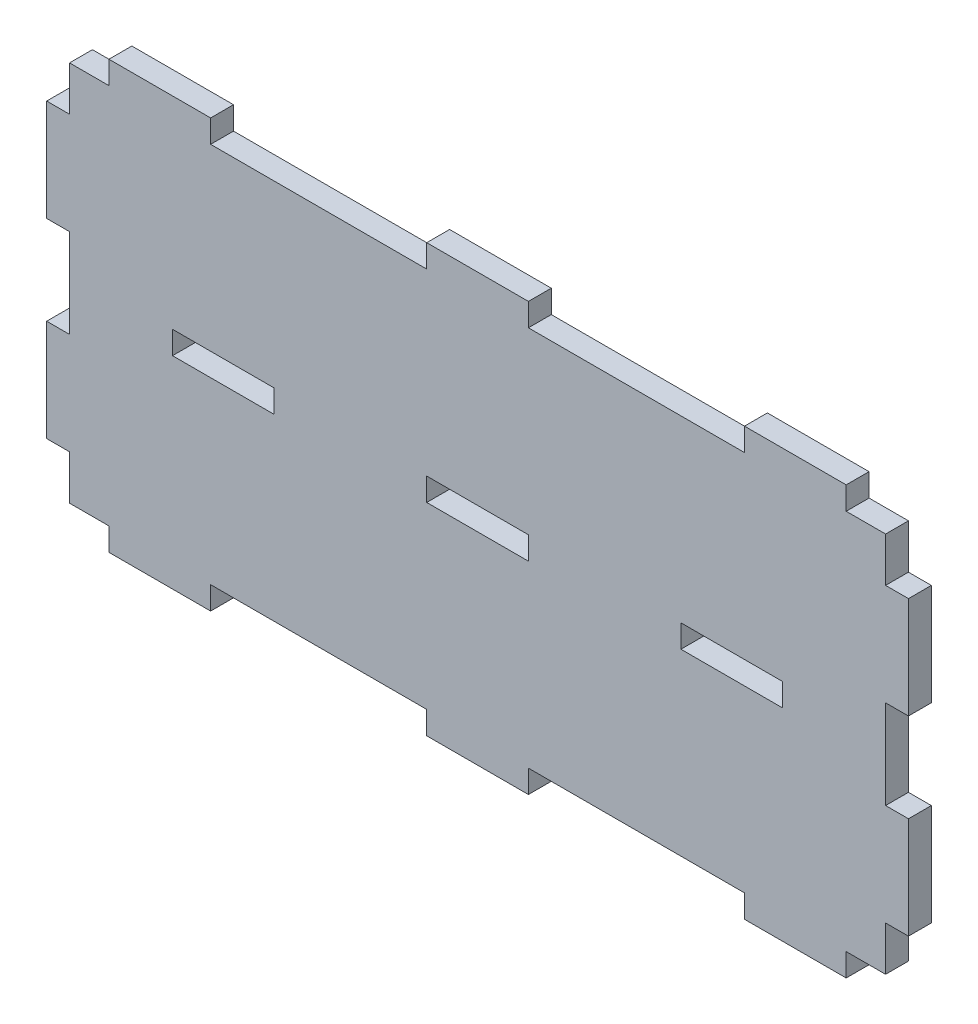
ISO-10303-21;
HEADER;
FILE_DESCRIPTION(('STEP AP214'),'2;1');
FILE_NAME('part.step','',(''),(''),'','','');
FILE_SCHEMA(('AUTOMOTIVE_DESIGN { 1 0 10303 214 1 1 1 1 }'));
ENDSEC;
DATA;
#1=APPLICATION_CONTEXT('core data for automotive mechanical design processes');
#2=APPLICATION_PROTOCOL_DEFINITION('international standard','automotive_design',2000,#1);
#3=PRODUCT_CONTEXT('',#1,'mechanical');
#4=PRODUCT('Part','Part','',(#3));
#5=PRODUCT_RELATED_PRODUCT_CATEGORY('part','',(#4));
#6=PRODUCT_DEFINITION_FORMATION('','',#4);
#7=PRODUCT_DEFINITION_CONTEXT('part definition',#1,'design');
#8=PRODUCT_DEFINITION('design','',#6,#7);
#9=PRODUCT_DEFINITION_SHAPE('','',#8);
#10=(LENGTH_UNIT() NAMED_UNIT(*) SI_UNIT(.MILLI.,.METRE.));
#11=(NAMED_UNIT(*) PLANE_ANGLE_UNIT() SI_UNIT($,.RADIAN.));
#12=(NAMED_UNIT(*) SI_UNIT($,.STERADIAN.) SOLID_ANGLE_UNIT());
#13=UNCERTAINTY_MEASURE_WITH_UNIT(LENGTH_MEASURE(1.E-05),#10,'distance_accuracy_value','');
#14=(GEOMETRIC_REPRESENTATION_CONTEXT(3) GLOBAL_UNCERTAINTY_ASSIGNED_CONTEXT((#13)) GLOBAL_UNIT_ASSIGNED_CONTEXT((#10,
#11,#12)) REPRESENTATION_CONTEXT('',''));
#15=CARTESIAN_POINT('',(0.,0.,0.));
#16=DIRECTION('',(0.,0.,1.));
#17=DIRECTION('',(1.,0.,0.));
#18=AXIS2_PLACEMENT_3D('',#15,#16,#17);
#19=CARTESIAN_POINT('',(321.,150.,18.));
#20=DIRECTION('',(-1.,0.,0.));
#21=DIRECTION('',(0.,-1.,0.));
#22=AXIS2_PLACEMENT_3D('',#19,#20,#21);
#23=PLANE('',#22);
#24=DIRECTION('',(0.,1.,0.));
#25=VECTOR('',#24,1.);
#26=CARTESIAN_POINT('',(321.,150.,0.));
#27=LINE('',#26,#25);
#28=CARTESIAN_POINT('',(321.,-34.9999999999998,0.));
#29=VERTEX_POINT('',#28);
#30=CARTESIAN_POINT('',(321.,35.0000000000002,0.));
#31=VERTEX_POINT('',#30);
#32=EDGE_CURVE('E782',#29,#31,#27,.T.);
#33=ORIENTED_EDGE('',*,*,#32,.T.);
#34=DIRECTION('',(0.,0.,1.));
#35=VECTOR('',#34,1.);
#36=CARTESIAN_POINT('',(321.,35.0000000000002,0.));
#37=LINE('',#36,#35);
#38=CARTESIAN_POINT('',(321.,35.0000000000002,18.));
#39=VERTEX_POINT('',#38);
#40=EDGE_CURVE('E509',#31,#39,#37,.T.);
#41=ORIENTED_EDGE('',*,*,#40,.T.);
#42=DIRECTION('',(0.,1.,0.));
#43=VECTOR('',#42,1.);
#44=CARTESIAN_POINT('',(321.,150.,18.));
#45=LINE('',#44,#43);
#46=CARTESIAN_POINT('',(321.,-34.9999999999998,18.));
#47=VERTEX_POINT('',#46);
#48=EDGE_CURVE('E759',#47,#39,#45,.T.);
#49=ORIENTED_EDGE('',*,*,#48,.F.);
#50=DIRECTION('',(0.,0.,1.));
#51=VECTOR('',#50,1.);
#52=CARTESIAN_POINT('',(321.,-34.9999999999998,0.));
#53=LINE('',#52,#51);
#54=EDGE_CURVE('E538',#29,#47,#53,.T.);
#55=ORIENTED_EDGE('',*,*,#54,.F.);
#56=EDGE_LOOP('',(#33,#41,#49,#55));
#57=FACE_BOUND('',#56,.T.);
#58=ADVANCED_FACE('F33',(#57),#23,.F.);
#59=CARTESIAN_POINT('',(321.,115.,18.));
#60=VERTEX_POINT('',#59);
#61=CARTESIAN_POINT('',(321.,150.,18.));
#62=VERTEX_POINT('',#61);
#63=EDGE_CURVE('E760',#60,#62,#45,.T.);
#64=ORIENTED_EDGE('',*,*,#63,.F.);
#65=DIRECTION('',(0.,0.,1.));
#66=VECTOR('',#65,1.);
#67=CARTESIAN_POINT('',(321.,115.,0.));
#68=LINE('',#67,#66);
#69=CARTESIAN_POINT('',(321.,115.,0.));
#70=VERTEX_POINT('',#69);
#71=EDGE_CURVE('E511',#70,#60,#68,.T.);
#72=ORIENTED_EDGE('',*,*,#71,.F.);
#73=CARTESIAN_POINT('',(321.,150.,0.));
#74=VERTEX_POINT('',#73);
#75=EDGE_CURVE('E748',#70,#74,#27,.T.);
#76=ORIENTED_EDGE('',*,*,#75,.T.);
#77=DIRECTION('',(0.,0.,-1.));
#78=VECTOR('',#77,1.);
#79=CARTESIAN_POINT('',(321.,150.,18.));
#80=LINE('',#79,#78);
#81=EDGE_CURVE('E11',#62,#74,#80,.T.);
#82=ORIENTED_EDGE('',*,*,#81,.F.);
#83=EDGE_LOOP('',(#64,#72,#76,#82));
#84=FACE_BOUND('',#83,.T.);
#85=ADVANCED_FACE('F870',(#84),#23,.F.);
#86=CARTESIAN_POINT('',(-321.,150.,18.));
#87=DIRECTION('',(1.,0.,0.));
#88=DIRECTION('',(0.,1.,0.));
#89=AXIS2_PLACEMENT_3D('',#86,#87,#88);
#90=PLANE('',#89);
#91=DIRECTION('',(0.,-1.,0.));
#92=VECTOR('',#91,1.);
#93=CARTESIAN_POINT('',(-321.,150.,0.));
#94=LINE('',#93,#92);
#95=CARTESIAN_POINT('',(-321.,35.,0.));
#96=VERTEX_POINT('',#95);
#97=CARTESIAN_POINT('',(-321.,-35.,0.));
#98=VERTEX_POINT('',#97);
#99=EDGE_CURVE('E792',#96,#98,#94,.T.);
#100=ORIENTED_EDGE('',*,*,#99,.T.);
#101=DIRECTION('',(0.,0.,1.));
#102=VECTOR('',#101,1.);
#103=CARTESIAN_POINT('',(-321.,-34.9999999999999,0.));
#104=LINE('',#103,#102);
#105=CARTESIAN_POINT('',(-321.,-35.,18.));
#106=VERTEX_POINT('',#105);
#107=EDGE_CURVE('E562',#98,#106,#104,.T.);
#108=ORIENTED_EDGE('',*,*,#107,.T.);
#109=DIRECTION('',(0.,-1.,0.));
#110=VECTOR('',#109,1.);
#111=CARTESIAN_POINT('',(-321.,150.,18.));
#112=LINE('',#111,#110);
#113=CARTESIAN_POINT('',(-321.,35.,18.));
#114=VERTEX_POINT('',#113);
#115=EDGE_CURVE('E771',#114,#106,#112,.T.);
#116=ORIENTED_EDGE('',*,*,#115,.F.);
#117=DIRECTION('',(0.,0.,1.));
#118=VECTOR('',#117,1.);
#119=CARTESIAN_POINT('',(-321.,35.,0.));
#120=LINE('',#119,#118);
#121=EDGE_CURVE('E585',#96,#114,#120,.T.);
#122=ORIENTED_EDGE('',*,*,#121,.F.);
#123=EDGE_LOOP('',(#100,#108,#116,#122));
#124=FACE_BOUND('',#123,.T.);
#125=ADVANCED_FACE('F875',(#124),#90,.F.);
#126=CARTESIAN_POINT('',(-321.,-115.,18.));
#127=VERTEX_POINT('',#126);
#128=CARTESIAN_POINT('',(-321.,-150.,18.));
#129=VERTEX_POINT('',#128);
#130=EDGE_CURVE('E764',#127,#129,#112,.T.);
#131=ORIENTED_EDGE('',*,*,#130,.F.);
#132=DIRECTION('',(0.,0.,1.));
#133=VECTOR('',#132,1.);
#134=CARTESIAN_POINT('',(-321.,-115.,0.));
#135=LINE('',#134,#133);
#136=CARTESIAN_POINT('',(-321.,-115.,0.));
#137=VERTEX_POINT('',#136);
#138=EDGE_CURVE('E564',#137,#127,#135,.T.);
#139=ORIENTED_EDGE('',*,*,#138,.F.);
#140=CARTESIAN_POINT('',(-321.,-150.,0.));
#141=VERTEX_POINT('',#140);
#142=EDGE_CURVE('E785',#137,#141,#94,.T.);
#143=ORIENTED_EDGE('',*,*,#142,.T.);
#144=DIRECTION('',(0.,0.,-1.));
#145=VECTOR('',#144,1.);
#146=CARTESIAN_POINT('',(-321.,-150.,18.));
#147=LINE('',#146,#145);
#148=EDGE_CURVE('E800',#129,#141,#147,.T.);
#149=ORIENTED_EDGE('',*,*,#148,.F.);
#150=EDGE_LOOP('',(#131,#139,#143,#149));
#151=FACE_BOUND('',#150,.T.);
#152=ADVANCED_FACE('F966',(#151),#90,.F.);
#153=CARTESIAN_POINT('',(-321.,150.,18.));
#154=DIRECTION('',(0.,-1.,0.));
#155=DIRECTION('',(0.,0.,-1.));
#156=AXIS2_PLACEMENT_3D('',#153,#154,#155);
#157=PLANE('',#156);
#158=DIRECTION('',(-1.,0.,0.));
#159=VECTOR('',#158,1.);
#160=CARTESIAN_POINT('',(-321.,150.,18.));
#161=LINE('',#160,#159);
#162=CARTESIAN_POINT('',(-290.,150.,18.));
#163=VERTEX_POINT('',#162);
#164=CARTESIAN_POINT('',(-321.,150.,18.));
#165=VERTEX_POINT('',#164);
#166=EDGE_CURVE('E758',#163,#165,#161,.T.);
#167=ORIENTED_EDGE('',*,*,#166,.F.);
#168=DIRECTION('',(0.,0.,1.));
#169=VECTOR('',#168,1.);
#170=CARTESIAN_POINT('',(-290.,150.,0.));
#171=LINE('',#170,#169);
#172=CARTESIAN_POINT('',(-290.,150.,0.));
#173=VERTEX_POINT('',#172);
#174=EDGE_CURVE('E604',#173,#163,#171,.T.);
#175=ORIENTED_EDGE('',*,*,#174,.F.);
#176=DIRECTION('',(-1.,0.,0.));
#177=VECTOR('',#176,1.);
#178=CARTESIAN_POINT('',(-321.,150.,0.));
#179=LINE('',#178,#177);
#180=CARTESIAN_POINT('',(-321.,150.,0.));
#181=VERTEX_POINT('',#180);
#182=EDGE_CURVE('E781',#173,#181,#179,.T.);
#183=ORIENTED_EDGE('',*,*,#182,.T.);
#184=DIRECTION('',(0.,0.,-1.));
#185=VECTOR('',#184,1.);
#186=CARTESIAN_POINT('',(-321.,150.,18.));
#187=LINE('',#186,#185);
#188=EDGE_CURVE('E41',#165,#181,#187,.T.);
#189=ORIENTED_EDGE('',*,*,#188,.F.);
#190=EDGE_LOOP('',(#167,#175,#183,#189));
#191=FACE_BOUND('',#190,.T.);
#192=ADVANCED_FACE('F834',(#191),#157,.F.);
#193=CARTESIAN_POINT('',(290.,150.,0.));
#194=VERTEX_POINT('',#193);
#195=EDGE_CURVE('E783',#74,#194,#179,.T.);
#196=ORIENTED_EDGE('',*,*,#195,.T.);
#197=DIRECTION('',(0.,0.,1.));
#198=VECTOR('',#197,1.);
#199=CARTESIAN_POINT('',(290.,150.,0.));
#200=LINE('',#199,#198);
#201=CARTESIAN_POINT('',(290.,150.,18.));
#202=VERTEX_POINT('',#201);
#203=EDGE_CURVE('E639',#194,#202,#200,.T.);
#204=ORIENTED_EDGE('',*,*,#203,.T.);
#205=EDGE_CURVE('E761',#62,#202,#161,.T.);
#206=ORIENTED_EDGE('',*,*,#205,.F.);
#207=ORIENTED_EDGE('',*,*,#81,.T.);
#208=EDGE_LOOP('',(#196,#204,#206,#207));
#209=FACE_BOUND('',#208,.T.);
#210=ADVANCED_FACE('F976',(#209),#157,.F.);
#211=CARTESIAN_POINT('',(-40.,150.,0.));
#212=VERTEX_POINT('',#211);
#213=CARTESIAN_POINT('',(-210.,150.,0.));
#214=VERTEX_POINT('',#213);
#215=EDGE_CURVE('E787',#212,#214,#179,.T.);
#216=ORIENTED_EDGE('',*,*,#215,.T.);
#217=DIRECTION('',(0.,0.,1.));
#218=VECTOR('',#217,1.);
#219=CARTESIAN_POINT('',(-210.,150.,0.));
#220=LINE('',#219,#218);
#221=CARTESIAN_POINT('',(-210.,150.,18.));
#222=VERTEX_POINT('',#221);
#223=EDGE_CURVE('E617',#214,#222,#220,.T.);
#224=ORIENTED_EDGE('',*,*,#223,.T.);
#225=CARTESIAN_POINT('',(-40.,150.,18.));
#226=VERTEX_POINT('',#225);
#227=EDGE_CURVE('E766',#226,#222,#161,.T.);
#228=ORIENTED_EDGE('',*,*,#227,.F.);
#229=DIRECTION('',(0.,0.,1.));
#230=VECTOR('',#229,1.);
#231=CARTESIAN_POINT('',(-40.,150.,0.));
#232=LINE('',#231,#230);
#233=EDGE_CURVE('E657',#212,#226,#232,.T.);
#234=ORIENTED_EDGE('',*,*,#233,.F.);
#235=EDGE_LOOP('',(#216,#224,#228,#234));
#236=FACE_BOUND('',#235,.T.);
#237=ADVANCED_FACE('F851',(#236),#157,.F.);
#238=CARTESIAN_POINT('',(-321.,-150.,18.));
#239=DIRECTION('',(0.,1.,0.));
#240=DIRECTION('',(0.,0.,1.));
#241=AXIS2_PLACEMENT_3D('',#238,#239,#240);
#242=PLANE('',#241);
#243=DIRECTION('',(1.,0.,0.));
#244=VECTOR('',#243,1.);
#245=CARTESIAN_POINT('',(-321.,-150.,18.));
#246=LINE('',#245,#244);
#247=CARTESIAN_POINT('',(40.,-150.,18.));
#248=VERTEX_POINT('',#247);
#249=CARTESIAN_POINT('',(210.,-150.,18.));
#250=VERTEX_POINT('',#249);
#251=EDGE_CURVE('E777',#248,#250,#246,.T.);
#252=ORIENTED_EDGE('',*,*,#251,.F.);
#253=DIRECTION('',(0.,0.,1.));
#254=VECTOR('',#253,1.);
#255=CARTESIAN_POINT('',(40.,-150.,0.));
#256=LINE('',#255,#254);
#257=CARTESIAN_POINT('',(40.,-150.,0.));
#258=VERTEX_POINT('',#257);
#259=EDGE_CURVE('E684',#258,#248,#256,.T.);
#260=ORIENTED_EDGE('',*,*,#259,.F.);
#261=DIRECTION('',(1.,0.,0.));
#262=VECTOR('',#261,1.);
#263=CARTESIAN_POINT('',(-321.,-150.,0.));
#264=LINE('',#263,#262);
#265=CARTESIAN_POINT('',(210.,-150.,0.));
#266=VERTEX_POINT('',#265);
#267=EDGE_CURVE('E797',#258,#266,#264,.T.);
#268=ORIENTED_EDGE('',*,*,#267,.T.);
#269=DIRECTION('',(0.,0.,1.));
#270=VECTOR('',#269,1.);
#271=CARTESIAN_POINT('',(210.,-150.,0.));
#272=LINE('',#271,#270);
#273=EDGE_CURVE('E724',#266,#250,#272,.T.);
#274=ORIENTED_EDGE('',*,*,#273,.T.);
#275=EDGE_LOOP('',(#252,#260,#268,#274));
#276=FACE_BOUND('',#275,.T.);
#277=ADVANCED_FACE('F921',(#276),#242,.F.);
#278=CARTESIAN_POINT('',(290.,-150.,18.));
#279=VERTEX_POINT('',#278);
#280=CARTESIAN_POINT('',(321.,-150.,18.));
#281=VERTEX_POINT('',#280);
#282=EDGE_CURVE('E770',#279,#281,#246,.T.);
#283=ORIENTED_EDGE('',*,*,#282,.F.);
#284=DIRECTION('',(0.,0.,1.));
#285=VECTOR('',#284,1.);
#286=CARTESIAN_POINT('',(290.,-150.,0.));
#287=LINE('',#286,#285);
#288=CARTESIAN_POINT('',(290.,-150.,0.));
#289=VERTEX_POINT('',#288);
#290=EDGE_CURVE('E711',#289,#279,#287,.T.);
#291=ORIENTED_EDGE('',*,*,#290,.F.);
#292=CARTESIAN_POINT('',(321.,-150.,0.));
#293=VERTEX_POINT('',#292);
#294=EDGE_CURVE('E791',#289,#293,#264,.T.);
#295=ORIENTED_EDGE('',*,*,#294,.T.);
#296=DIRECTION('',(0.,0.,-1.));
#297=VECTOR('',#296,1.);
#298=CARTESIAN_POINT('',(321.,-150.,18.));
#299=LINE('',#298,#297);
#300=EDGE_CURVE('E775',#281,#293,#299,.T.);
#301=ORIENTED_EDGE('',*,*,#300,.F.);
#302=EDGE_LOOP('',(#283,#291,#295,#301));
#303=FACE_BOUND('',#302,.T.);
#304=ADVANCED_FACE('F884',(#303),#242,.F.);
#305=CARTESIAN_POINT('',(-210.,-150.,0.));
#306=VERTEX_POINT('',#305);
#307=CARTESIAN_POINT('',(-40.,-150.,0.));
#308=VERTEX_POINT('',#307);
#309=EDGE_CURVE('E796',#306,#308,#264,.T.);
#310=ORIENTED_EDGE('',*,*,#309,.T.);
#311=DIRECTION('',(0.,0.,1.));
#312=VECTOR('',#311,1.);
#313=CARTESIAN_POINT('',(-40.,-150.,0.));
#314=LINE('',#313,#312);
#315=CARTESIAN_POINT('',(-40.,-150.,18.));
#316=VERTEX_POINT('',#315);
#317=EDGE_CURVE('E697',#308,#316,#314,.T.);
#318=ORIENTED_EDGE('',*,*,#317,.T.);
#319=CARTESIAN_POINT('',(-210.,-150.,18.));
#320=VERTEX_POINT('',#319);
#321=EDGE_CURVE('E776',#320,#316,#246,.T.);
#322=ORIENTED_EDGE('',*,*,#321,.F.);
#323=DIRECTION('',(0.,0.,1.));
#324=VECTOR('',#323,1.);
#325=CARTESIAN_POINT('',(-210.,-150.,0.));
#326=LINE('',#325,#324);
#327=EDGE_CURVE('E738',#306,#320,#326,.T.);
#328=ORIENTED_EDGE('',*,*,#327,.F.);
#329=EDGE_LOOP('',(#310,#318,#322,#328));
#330=FACE_BOUND('',#329,.T.);
#331=ADVANCED_FACE('F878',(#330),#242,.F.);
#332=CARTESIAN_POINT('',(321.,-115.,0.));
#333=VERTEX_POINT('',#332);
#334=EDGE_CURVE('E778',#293,#333,#27,.T.);
#335=ORIENTED_EDGE('',*,*,#334,.T.);
#336=DIRECTION('',(0.,0.,1.));
#337=VECTOR('',#336,1.);
#338=CARTESIAN_POINT('',(321.,-115.,0.));
#339=LINE('',#338,#337);
#340=CARTESIAN_POINT('',(321.,-115.,18.));
#341=VERTEX_POINT('',#340);
#342=EDGE_CURVE('E535',#333,#341,#339,.T.);
#343=ORIENTED_EDGE('',*,*,#342,.T.);
#344=EDGE_CURVE('E755',#281,#341,#45,.T.);
#345=ORIENTED_EDGE('',*,*,#344,.F.);
#346=ORIENTED_EDGE('',*,*,#300,.T.);
#347=EDGE_LOOP('',(#335,#343,#345,#346));
#348=FACE_BOUND('',#347,.T.);
#349=ADVANCED_FACE('F35',(#348),#23,.F.);
#350=CARTESIAN_POINT('',(210.,150.,18.));
#351=VERTEX_POINT('',#350);
#352=CARTESIAN_POINT('',(40.,150.,18.));
#353=VERTEX_POINT('',#352);
#354=EDGE_CURVE('E765',#351,#353,#161,.T.);
#355=ORIENTED_EDGE('',*,*,#354,.F.);
#356=DIRECTION('',(0.,0.,1.));
#357=VECTOR('',#356,1.);
#358=CARTESIAN_POINT('',(210.,150.,0.));
#359=LINE('',#358,#357);
#360=CARTESIAN_POINT('',(210.,150.,0.));
#361=VERTEX_POINT('',#360);
#362=EDGE_CURVE('E642',#361,#351,#359,.T.);
#363=ORIENTED_EDGE('',*,*,#362,.F.);
#364=CARTESIAN_POINT('',(40.,150.,0.));
#365=VERTEX_POINT('',#364);
#366=EDGE_CURVE('E786',#361,#365,#179,.T.);
#367=ORIENTED_EDGE('',*,*,#366,.T.);
#368=DIRECTION('',(0.,0.,1.));
#369=VECTOR('',#368,1.);
#370=CARTESIAN_POINT('',(40.,150.,0.));
#371=LINE('',#370,#369);
#372=EDGE_CURVE('E670',#365,#353,#371,.T.);
#373=ORIENTED_EDGE('',*,*,#372,.T.);
#374=EDGE_LOOP('',(#355,#363,#367,#373));
#375=FACE_BOUND('',#374,.T.);
#376=ADVANCED_FACE('F832',(#375),#157,.F.);
#377=CARTESIAN_POINT('',(-321.,115.,0.));
#378=VERTEX_POINT('',#377);
#379=EDGE_CURVE('E788',#181,#378,#94,.T.);
#380=ORIENTED_EDGE('',*,*,#379,.T.);
#381=DIRECTION('',(0.,0.,1.));
#382=VECTOR('',#381,1.);
#383=CARTESIAN_POINT('',(-321.,115.,0.));
#384=LINE('',#383,#382);
#385=CARTESIAN_POINT('',(-321.,115.,18.));
#386=VERTEX_POINT('',#385);
#387=EDGE_CURVE('E577',#378,#386,#384,.T.);
#388=ORIENTED_EDGE('',*,*,#387,.T.);
#389=EDGE_CURVE('E767',#165,#386,#112,.T.);
#390=ORIENTED_EDGE('',*,*,#389,.F.);
#391=ORIENTED_EDGE('',*,*,#188,.T.);
#392=EDGE_LOOP('',(#380,#388,#390,#391));
#393=FACE_BOUND('',#392,.T.);
#394=ADVANCED_FACE('F807',(#393),#90,.F.);
#395=CARTESIAN_POINT('',(-290.,-150.,0.));
#396=VERTEX_POINT('',#395);
#397=EDGE_CURVE('E793',#141,#396,#264,.T.);
#398=ORIENTED_EDGE('',*,*,#397,.T.);
#399=DIRECTION('',(0.,0.,1.));
#400=VECTOR('',#399,1.);
#401=CARTESIAN_POINT('',(-290.,-150.,0.));
#402=LINE('',#401,#400);
#403=CARTESIAN_POINT('',(-290.,-150.,18.));
#404=VERTEX_POINT('',#403);
#405=EDGE_CURVE('E751',#396,#404,#402,.T.);
#406=ORIENTED_EDGE('',*,*,#405,.T.);
#407=EDGE_CURVE('E772',#129,#404,#246,.T.);
#408=ORIENTED_EDGE('',*,*,#407,.F.);
#409=ORIENTED_EDGE('',*,*,#148,.T.);
#410=EDGE_LOOP('',(#398,#406,#408,#409));
#411=FACE_BOUND('',#410,.T.);
#412=ADVANCED_FACE('F887',(#411),#242,.F.);
#413=CARTESIAN_POINT('',(0.,0.,18.));
#414=DIRECTION('',(0.,0.,1.));
#415=DIRECTION('',(1.,0.,0.));
#416=AXIS2_PLACEMENT_3D('',#413,#414,#415);
#417=PLANE('',#416);
#418=DIRECTION('',(0.,1.,0.));
#419=VECTOR('',#418,1.);
#420=CARTESIAN_POINT('',(-160.,9.,18.));
#421=LINE('',#420,#419);
#422=CARTESIAN_POINT('',(-160.,-9.,18.));
#423=VERTEX_POINT('',#422);
#424=CARTESIAN_POINT('',(-160.,9.,18.));
#425=VERTEX_POINT('',#424);
#426=EDGE_CURVE('E48',#423,#425,#421,.T.);
#427=ORIENTED_EDGE('',*,*,#426,.F.);
#428=DIRECTION('',(1.,0.,0.));
#429=VECTOR('',#428,1.);
#430=CARTESIAN_POINT('',(-240.,-9.,18.));
#431=LINE('',#430,#429);
#432=CARTESIAN_POINT('',(-240.,-9.,18.));
#433=VERTEX_POINT('',#432);
#434=EDGE_CURVE('E407',#433,#423,#431,.T.);
#435=ORIENTED_EDGE('',*,*,#434,.F.);
#436=DIRECTION('',(0.,-1.,0.));
#437=VECTOR('',#436,1.);
#438=CARTESIAN_POINT('',(-240.,9.,18.));
#439=LINE('',#438,#437);
#440=CARTESIAN_POINT('',(-240.,9.,18.));
#441=VERTEX_POINT('',#440);
#442=EDGE_CURVE('E410',#441,#433,#439,.T.);
#443=ORIENTED_EDGE('',*,*,#442,.F.);
#444=DIRECTION('',(-1.,0.,0.));
#445=VECTOR('',#444,1.);
#446=CARTESIAN_POINT('',(-240.,9.,18.));
#447=LINE('',#446,#445);
#448=EDGE_CURVE('E416',#425,#441,#447,.T.);
#449=ORIENTED_EDGE('',*,*,#448,.F.);
#450=EDGE_LOOP('',(#427,#435,#443,#449));
#451=FACE_BOUND('',#450,.T.);
#452=DIRECTION('',(0.,1.,0.));
#453=VECTOR('',#452,1.);
#454=CARTESIAN_POINT('',(240.,9.00000000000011,18.));
#455=LINE('',#454,#453);
#456=CARTESIAN_POINT('',(240.,-8.99999999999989,18.));
#457=VERTEX_POINT('',#456);
#458=CARTESIAN_POINT('',(240.,9.00000000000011,18.));
#459=VERTEX_POINT('',#458);
#460=EDGE_CURVE('E56',#457,#459,#455,.T.);
#461=ORIENTED_EDGE('',*,*,#460,.F.);
#462=DIRECTION('',(1.,0.,0.));
#463=VECTOR('',#462,1.);
#464=CARTESIAN_POINT('',(240.,-8.99999999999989,18.));
#465=LINE('',#464,#463);
#466=CARTESIAN_POINT('',(160.,-8.99999999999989,18.));
#467=VERTEX_POINT('',#466);
#468=EDGE_CURVE('E431',#467,#457,#465,.T.);
#469=ORIENTED_EDGE('',*,*,#468,.F.);
#470=DIRECTION('',(0.,-1.,0.));
#471=VECTOR('',#470,1.);
#472=CARTESIAN_POINT('',(160.,9.00000000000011,18.));
#473=LINE('',#472,#471);
#474=CARTESIAN_POINT('',(160.,9.00000000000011,18.));
#475=VERTEX_POINT('',#474);
#476=EDGE_CURVE('E445',#475,#467,#473,.T.);
#477=ORIENTED_EDGE('',*,*,#476,.F.);
#478=DIRECTION('',(-1.,0.,0.));
#479=VECTOR('',#478,1.);
#480=CARTESIAN_POINT('',(240.,9.00000000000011,18.));
#481=LINE('',#480,#479);
#482=EDGE_CURVE('E442',#459,#475,#481,.T.);
#483=ORIENTED_EDGE('',*,*,#482,.F.);
#484=EDGE_LOOP('',(#461,#469,#477,#483));
#485=FACE_BOUND('',#484,.T.);
#486=DIRECTION('',(0.,1.,0.));
#487=VECTOR('',#486,1.);
#488=CARTESIAN_POINT('',(40.,9.,18.));
#489=LINE('',#488,#487);
#490=CARTESIAN_POINT('',(40.,-9.,18.));
#491=VERTEX_POINT('',#490);
#492=CARTESIAN_POINT('',(40.,9.,18.));
#493=VERTEX_POINT('',#492);
#494=EDGE_CURVE('E423',#491,#493,#489,.T.);
#495=ORIENTED_EDGE('',*,*,#494,.F.);
#496=DIRECTION('',(1.,0.,0.));
#497=VECTOR('',#496,1.);
#498=CARTESIAN_POINT('',(-40.,-9.,18.));
#499=LINE('',#498,#497);
#500=CARTESIAN_POINT('',(-40.,-9.,18.));
#501=VERTEX_POINT('',#500);
#502=EDGE_CURVE('E460',#501,#491,#499,.T.);
#503=ORIENTED_EDGE('',*,*,#502,.F.);
#504=DIRECTION('',(0.,-1.,0.));
#505=VECTOR('',#504,1.);
#506=CARTESIAN_POINT('',(-40.,9.,18.));
#507=LINE('',#506,#505);
#508=CARTESIAN_POINT('',(-40.,9.,18.));
#509=VERTEX_POINT('',#508);
#510=EDGE_CURVE('E474',#509,#501,#507,.T.);
#511=ORIENTED_EDGE('',*,*,#510,.F.);
#512=DIRECTION('',(-1.,0.,0.));
#513=VECTOR('',#512,1.);
#514=CARTESIAN_POINT('',(-40.,9.,18.));
#515=LINE('',#514,#513);
#516=EDGE_CURVE('E471',#493,#509,#515,.T.);
#517=ORIENTED_EDGE('',*,*,#516,.F.);
#518=EDGE_LOOP('',(#495,#503,#511,#517));
#519=FACE_BOUND('',#518,.T.);
#520=ORIENTED_EDGE('',*,*,#344,.T.);
#521=DIRECTION('',(1.,0.,0.));
#522=VECTOR('',#521,1.);
#523=CARTESIAN_POINT('',(339.,-115.,18.));
#524=LINE('',#523,#522);
#525=CARTESIAN_POINT('',(339.,-115.,18.));
#526=VERTEX_POINT('',#525);
#527=EDGE_CURVE('E519',#341,#526,#524,.T.);
#528=ORIENTED_EDGE('',*,*,#527,.T.);
#529=DIRECTION('',(0.,1.,0.));
#530=VECTOR('',#529,1.);
#531=CARTESIAN_POINT('',(339.,-115.,18.));
#532=LINE('',#531,#530);
#533=CARTESIAN_POINT('',(339.,-34.9999999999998,18.));
#534=VERTEX_POINT('',#533);
#535=EDGE_CURVE('E508',#526,#534,#532,.T.);
#536=ORIENTED_EDGE('',*,*,#535,.T.);
#537=DIRECTION('',(-1.,0.,0.));
#538=VECTOR('',#537,1.);
#539=CARTESIAN_POINT('',(339.,-34.9999999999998,18.));
#540=LINE('',#539,#538);
#541=EDGE_CURVE('E527',#534,#47,#540,.T.);
#542=ORIENTED_EDGE('',*,*,#541,.T.);
#543=ORIENTED_EDGE('',*,*,#48,.T.);
#544=DIRECTION('',(1.,0.,0.));
#545=VECTOR('',#544,1.);
#546=CARTESIAN_POINT('',(339.,35.0000000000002,18.));
#547=LINE('',#546,#545);
#548=CARTESIAN_POINT('',(339.,35.0000000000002,18.));
#549=VERTEX_POINT('',#548);
#550=EDGE_CURVE('E492',#39,#549,#547,.T.);
#551=ORIENTED_EDGE('',*,*,#550,.T.);
#552=DIRECTION('',(0.,1.,0.));
#553=VECTOR('',#552,1.);
#554=CARTESIAN_POINT('',(339.,115.,18.));
#555=LINE('',#554,#553);
#556=CARTESIAN_POINT('',(339.,115.,18.));
#557=VERTEX_POINT('',#556);
#558=EDGE_CURVE('E481',#549,#557,#555,.T.);
#559=ORIENTED_EDGE('',*,*,#558,.T.);
#560=DIRECTION('',(-1.,0.,0.));
#561=VECTOR('',#560,1.);
#562=CARTESIAN_POINT('',(339.,115.,18.));
#563=LINE('',#562,#561);
#564=EDGE_CURVE('E501',#557,#60,#563,.T.);
#565=ORIENTED_EDGE('',*,*,#564,.T.);
#566=ORIENTED_EDGE('',*,*,#63,.T.);
#567=ORIENTED_EDGE('',*,*,#205,.T.);
#568=DIRECTION('',(0.,1.,0.));
#569=VECTOR('',#568,1.);
#570=CARTESIAN_POINT('',(290.,168.,18.));
#571=LINE('',#570,#569);
#572=CARTESIAN_POINT('',(290.,168.,18.));
#573=VERTEX_POINT('',#572);
#574=EDGE_CURVE('E614',#202,#573,#571,.T.);
#575=ORIENTED_EDGE('',*,*,#574,.T.);
#576=DIRECTION('',(-1.,0.,0.));
#577=VECTOR('',#576,1.);
#578=CARTESIAN_POINT('',(290.,168.,18.));
#579=LINE('',#578,#577);
#580=CARTESIAN_POINT('',(210.,168.,18.));
#581=VERTEX_POINT('',#580);
#582=EDGE_CURVE('E634',#573,#581,#579,.T.);
#583=ORIENTED_EDGE('',*,*,#582,.T.);
#584=DIRECTION('',(0.,-1.,0.));
#585=VECTOR('',#584,1.);
#586=CARTESIAN_POINT('',(210.,168.,18.));
#587=LINE('',#586,#585);
#588=EDGE_CURVE('E625',#581,#351,#587,.T.);
#589=ORIENTED_EDGE('',*,*,#588,.T.);
#590=ORIENTED_EDGE('',*,*,#354,.T.);
#591=DIRECTION('',(0.,1.,0.));
#592=VECTOR('',#591,1.);
#593=CARTESIAN_POINT('',(40.,168.,18.));
#594=LINE('',#593,#592);
#595=CARTESIAN_POINT('',(40.,168.,18.));
#596=VERTEX_POINT('',#595);
#597=EDGE_CURVE('E660',#353,#596,#594,.T.);
#598=ORIENTED_EDGE('',*,*,#597,.T.);
#599=DIRECTION('',(-1.,0.,0.));
#600=VECTOR('',#599,1.);
#601=CARTESIAN_POINT('',(-40.,168.,18.));
#602=LINE('',#601,#600);
#603=CARTESIAN_POINT('',(-40.,168.,18.));
#604=VERTEX_POINT('',#603);
#605=EDGE_CURVE('E651',#596,#604,#602,.T.);
#606=ORIENTED_EDGE('',*,*,#605,.T.);
#607=DIRECTION('',(0.,-1.,0.));
#608=VECTOR('',#607,1.);
#609=CARTESIAN_POINT('',(-40.,168.,18.));
#610=LINE('',#609,#608);
#611=EDGE_CURVE('E641',#604,#226,#610,.T.);
#612=ORIENTED_EDGE('',*,*,#611,.T.);
#613=ORIENTED_EDGE('',*,*,#227,.T.);
#614=DIRECTION('',(0.,1.,0.));
#615=VECTOR('',#614,1.);
#616=CARTESIAN_POINT('',(-210.,168.,18.));
#617=LINE('',#616,#615);
#618=CARTESIAN_POINT('',(-210.,168.,18.));
#619=VERTEX_POINT('',#618);
#620=EDGE_CURVE('E607',#222,#619,#617,.T.);
#621=ORIENTED_EDGE('',*,*,#620,.T.);
#622=DIRECTION('',(-1.,0.,0.));
#623=VECTOR('',#622,1.);
#624=CARTESIAN_POINT('',(-290.,168.,18.));
#625=LINE('',#624,#623);
#626=CARTESIAN_POINT('',(-290.,168.,18.));
#627=VERTEX_POINT('',#626);
#628=EDGE_CURVE('E598',#619,#627,#625,.T.);
#629=ORIENTED_EDGE('',*,*,#628,.T.);
#630=DIRECTION('',(0.,-1.,0.));
#631=VECTOR('',#630,1.);
#632=CARTESIAN_POINT('',(-290.,168.,18.));
#633=LINE('',#632,#631);
#634=EDGE_CURVE('E587',#627,#163,#633,.T.);
#635=ORIENTED_EDGE('',*,*,#634,.T.);
#636=ORIENTED_EDGE('',*,*,#166,.T.);
#637=ORIENTED_EDGE('',*,*,#389,.T.);
#638=DIRECTION('',(-1.,0.,0.));
#639=VECTOR('',#638,1.);
#640=CARTESIAN_POINT('',(-339.,115.,18.));
#641=LINE('',#640,#639);
#642=CARTESIAN_POINT('',(-339.,115.,18.));
#643=VERTEX_POINT('',#642);
#644=EDGE_CURVE('E561',#386,#643,#641,.T.);
#645=ORIENTED_EDGE('',*,*,#644,.T.);
#646=DIRECTION('',(0.,-1.,0.));
#647=VECTOR('',#646,1.);
#648=CARTESIAN_POINT('',(-339.,115.,18.));
#649=LINE('',#648,#647);
#650=CARTESIAN_POINT('',(-339.,35.0000000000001,18.));
#651=VERTEX_POINT('',#650);
#652=EDGE_CURVE('E580',#643,#651,#649,.T.);
#653=ORIENTED_EDGE('',*,*,#652,.T.);
#654=DIRECTION('',(1.,0.,0.));
#655=VECTOR('',#654,1.);
#656=CARTESIAN_POINT('',(-339.,35.0000000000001,18.));
#657=LINE('',#656,#655);
#658=EDGE_CURVE('E572',#651,#114,#657,.T.);
#659=ORIENTED_EDGE('',*,*,#658,.T.);
#660=ORIENTED_EDGE('',*,*,#115,.T.);
#661=DIRECTION('',(-1.,0.,0.));
#662=VECTOR('',#661,1.);
#663=CARTESIAN_POINT('',(-339.,-35.,18.));
#664=LINE('',#663,#662);
#665=CARTESIAN_POINT('',(-339.,-35.,18.));
#666=VERTEX_POINT('',#665);
#667=EDGE_CURVE('E545',#106,#666,#664,.T.);
#668=ORIENTED_EDGE('',*,*,#667,.T.);
#669=DIRECTION('',(0.,-1.,0.));
#670=VECTOR('',#669,1.);
#671=CARTESIAN_POINT('',(-339.,-115.,18.));
#672=LINE('',#671,#670);
#673=CARTESIAN_POINT('',(-339.,-115.,18.));
#674=VERTEX_POINT('',#673);
#675=EDGE_CURVE('E534',#666,#674,#672,.T.);
#676=ORIENTED_EDGE('',*,*,#675,.T.);
#677=DIRECTION('',(1.,0.,0.));
#678=VECTOR('',#677,1.);
#679=CARTESIAN_POINT('',(-339.,-115.,18.));
#680=LINE('',#679,#678);
#681=EDGE_CURVE('E554',#674,#127,#680,.T.);
#682=ORIENTED_EDGE('',*,*,#681,.T.);
#683=ORIENTED_EDGE('',*,*,#130,.T.);
#684=ORIENTED_EDGE('',*,*,#407,.T.);
#685=DIRECTION('',(0.,-1.,0.));
#686=VECTOR('',#685,1.);
#687=CARTESIAN_POINT('',(-290.,-168.,18.));
#688=LINE('',#687,#686);
#689=CARTESIAN_POINT('',(-290.,-168.,18.));
#690=VERTEX_POINT('',#689);
#691=EDGE_CURVE('E741',#404,#690,#688,.T.);
#692=ORIENTED_EDGE('',*,*,#691,.T.);
#693=DIRECTION('',(1.,0.,0.));
#694=VECTOR('',#693,1.);
#695=CARTESIAN_POINT('',(-290.,-168.,18.));
#696=LINE('',#695,#694);
#697=CARTESIAN_POINT('',(-210.,-168.,18.));
#698=VERTEX_POINT('',#697);
#699=EDGE_CURVE('E732',#690,#698,#696,.T.);
#700=ORIENTED_EDGE('',*,*,#699,.T.);
#701=DIRECTION('',(0.,1.,0.));
#702=VECTOR('',#701,1.);
#703=CARTESIAN_POINT('',(-210.,-168.,18.));
#704=LINE('',#703,#702);
#705=EDGE_CURVE('E721',#698,#320,#704,.T.);
#706=ORIENTED_EDGE('',*,*,#705,.T.);
#707=ORIENTED_EDGE('',*,*,#321,.T.);
#708=DIRECTION('',(0.,-1.,0.));
#709=VECTOR('',#708,1.);
#710=CARTESIAN_POINT('',(-40.,-168.,18.));
#711=LINE('',#710,#709);
#712=CARTESIAN_POINT('',(-40.,-168.,18.));
#713=VERTEX_POINT('',#712);
#714=EDGE_CURVE('E687',#316,#713,#711,.T.);
#715=ORIENTED_EDGE('',*,*,#714,.T.);
#716=DIRECTION('',(1.,0.,0.));
#717=VECTOR('',#716,1.);
#718=CARTESIAN_POINT('',(-40.,-168.,18.));
#719=LINE('',#718,#717);
#720=CARTESIAN_POINT('',(40.,-168.,18.));
#721=VERTEX_POINT('',#720);
#722=EDGE_CURVE('E678',#713,#721,#719,.T.);
#723=ORIENTED_EDGE('',*,*,#722,.T.);
#724=DIRECTION('',(0.,1.,0.));
#725=VECTOR('',#724,1.);
#726=CARTESIAN_POINT('',(40.,-168.,18.));
#727=LINE('',#726,#725);
#728=EDGE_CURVE('E667',#721,#248,#727,.T.);
#729=ORIENTED_EDGE('',*,*,#728,.T.);
#730=ORIENTED_EDGE('',*,*,#251,.T.);
#731=DIRECTION('',(0.,-1.,0.));
#732=VECTOR('',#731,1.);
#733=CARTESIAN_POINT('',(210.,-168.,18.));
#734=LINE('',#733,#732);
#735=CARTESIAN_POINT('',(210.,-168.,18.));
#736=VERTEX_POINT('',#735);
#737=EDGE_CURVE('E714',#250,#736,#734,.T.);
#738=ORIENTED_EDGE('',*,*,#737,.T.);
#739=DIRECTION('',(1.,0.,0.));
#740=VECTOR('',#739,1.);
#741=CARTESIAN_POINT('',(290.,-168.,18.));
#742=LINE('',#741,#740);
#743=CARTESIAN_POINT('',(290.,-168.,18.));
#744=VERTEX_POINT('',#743);
#745=EDGE_CURVE('E705',#736,#744,#742,.T.);
#746=ORIENTED_EDGE('',*,*,#745,.T.);
#747=DIRECTION('',(0.,1.,0.));
#748=VECTOR('',#747,1.);
#749=CARTESIAN_POINT('',(290.,-168.,18.));
#750=LINE('',#749,#748);
#751=EDGE_CURVE('E694',#744,#279,#750,.T.);
#752=ORIENTED_EDGE('',*,*,#751,.T.);
#753=ORIENTED_EDGE('',*,*,#282,.T.);
#754=EDGE_LOOP('',(#520,#528,#536,#542,#543,#551,#559,#565,#566,#567,#575,#583,#589,#590,#598,
#606,#612,#613,#621,#629,#635,#636,#637,#645,#653,#659,#660,#668,#676,#682,#683,#684,#692,#700,
#706,#707,#715,#723,#729,#730,#738,#746,#752,#753));
#755=FACE_BOUND('',#754,.T.);
#756=ADVANCED_FACE('F820',(#451,#485,#519,#755),#417,.T.);
#757=CARTESIAN_POINT('',(0.,0.,0.));
#758=DIRECTION('',(0.,0.,1.));
#759=DIRECTION('',(1.,0.,0.));
#760=AXIS2_PLACEMENT_3D('',#757,#758,#759);
#761=PLANE('',#760);
#762=DIRECTION('',(1.,0.,0.));
#763=VECTOR('',#762,1.);
#764=CARTESIAN_POINT('',(-240.,-9.,0.));
#765=LINE('',#764,#763);
#766=CARTESIAN_POINT('',(-240.,-9.,0.));
#767=VERTEX_POINT('',#766);
#768=CARTESIAN_POINT('',(-160.,-9.,0.));
#769=VERTEX_POINT('',#768);
#770=EDGE_CURVE('E394',#767,#769,#765,.T.);
#771=ORIENTED_EDGE('',*,*,#770,.T.);
#772=DIRECTION('',(0.,1.,0.));
#773=VECTOR('',#772,1.);
#774=CARTESIAN_POINT('',(-160.,9.,0.));
#775=LINE('',#774,#773);
#776=CARTESIAN_POINT('',(-160.,9.,0.));
#777=VERTEX_POINT('',#776);
#778=EDGE_CURVE('E388',#769,#777,#775,.T.);
#779=ORIENTED_EDGE('',*,*,#778,.T.);
#780=DIRECTION('',(-1.,0.,0.));
#781=VECTOR('',#780,1.);
#782=CARTESIAN_POINT('',(-240.,9.,0.));
#783=LINE('',#782,#781);
#784=CARTESIAN_POINT('',(-240.,9.,0.));
#785=VERTEX_POINT('',#784);
#786=EDGE_CURVE('E398',#777,#785,#783,.T.);
#787=ORIENTED_EDGE('',*,*,#786,.T.);
#788=DIRECTION('',(0.,-1.,0.));
#789=VECTOR('',#788,1.);
#790=CARTESIAN_POINT('',(-240.,9.,0.));
#791=LINE('',#790,#789);
#792=EDGE_CURVE('E402',#785,#767,#791,.T.);
#793=ORIENTED_EDGE('',*,*,#792,.T.);
#794=EDGE_LOOP('',(#771,#779,#787,#793));
#795=FACE_BOUND('',#794,.T.);
#796=DIRECTION('',(1.,0.,0.));
#797=VECTOR('',#796,1.);
#798=CARTESIAN_POINT('',(240.,-8.99999999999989,0.));
#799=LINE('',#798,#797);
#800=CARTESIAN_POINT('',(160.,-8.99999999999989,0.));
#801=VERTEX_POINT('',#800);
#802=CARTESIAN_POINT('',(240.,-8.99999999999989,0.));
#803=VERTEX_POINT('',#802);
#804=EDGE_CURVE('E437',#801,#803,#799,.T.);
#805=ORIENTED_EDGE('',*,*,#804,.T.);
#806=DIRECTION('',(0.,1.,0.));
#807=VECTOR('',#806,1.);
#808=CARTESIAN_POINT('',(240.,9.00000000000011,0.));
#809=LINE('',#808,#807);
#810=CARTESIAN_POINT('',(240.,9.00000000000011,0.));
#811=VERTEX_POINT('',#810);
#812=EDGE_CURVE('E427',#803,#811,#809,.T.);
#813=ORIENTED_EDGE('',*,*,#812,.T.);
#814=DIRECTION('',(-1.,0.,0.));
#815=VECTOR('',#814,1.);
#816=CARTESIAN_POINT('',(240.,9.00000000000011,0.));
#817=LINE('',#816,#815);
#818=CARTESIAN_POINT('',(160.,9.00000000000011,0.));
#819=VERTEX_POINT('',#818);
#820=EDGE_CURVE('E430',#811,#819,#817,.T.);
#821=ORIENTED_EDGE('',*,*,#820,.T.);
#822=DIRECTION('',(0.,-1.,0.));
#823=VECTOR('',#822,1.);
#824=CARTESIAN_POINT('',(160.,9.00000000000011,0.));
#825=LINE('',#824,#823);
#826=EDGE_CURVE('E434',#819,#801,#825,.T.);
#827=ORIENTED_EDGE('',*,*,#826,.T.);
#828=EDGE_LOOP('',(#805,#813,#821,#827));
#829=FACE_BOUND('',#828,.T.);
#830=DIRECTION('',(1.,0.,0.));
#831=VECTOR('',#830,1.);
#832=CARTESIAN_POINT('',(-40.,-9.,0.));
#833=LINE('',#832,#831);
#834=CARTESIAN_POINT('',(-40.,-9.,0.));
#835=VERTEX_POINT('',#834);
#836=CARTESIAN_POINT('',(40.,-9.,0.));
#837=VERTEX_POINT('',#836);
#838=EDGE_CURVE('E466',#835,#837,#833,.T.);
#839=ORIENTED_EDGE('',*,*,#838,.T.);
#840=DIRECTION('',(0.,1.,0.));
#841=VECTOR('',#840,1.);
#842=CARTESIAN_POINT('',(40.,9.,0.));
#843=LINE('',#842,#841);
#844=CARTESIAN_POINT('',(40.,9.,0.));
#845=VERTEX_POINT('',#844);
#846=EDGE_CURVE('E456',#837,#845,#843,.T.);
#847=ORIENTED_EDGE('',*,*,#846,.T.);
#848=DIRECTION('',(-1.,0.,0.));
#849=VECTOR('',#848,1.);
#850=CARTESIAN_POINT('',(-40.,9.,0.));
#851=LINE('',#850,#849);
#852=CARTESIAN_POINT('',(-40.,9.,0.));
#853=VERTEX_POINT('',#852);
#854=EDGE_CURVE('E459',#845,#853,#851,.T.);
#855=ORIENTED_EDGE('',*,*,#854,.T.);
#856=DIRECTION('',(0.,-1.,0.));
#857=VECTOR('',#856,1.);
#858=CARTESIAN_POINT('',(-40.,9.,0.));
#859=LINE('',#858,#857);
#860=EDGE_CURVE('E463',#853,#835,#859,.T.);
#861=ORIENTED_EDGE('',*,*,#860,.T.);
#862=EDGE_LOOP('',(#839,#847,#855,#861));
#863=FACE_BOUND('',#862,.T.);
#864=ORIENTED_EDGE('',*,*,#334,.F.);
#865=ORIENTED_EDGE('',*,*,#294,.F.);
#866=DIRECTION('',(0.,1.,0.));
#867=VECTOR('',#866,1.);
#868=CARTESIAN_POINT('',(290.,-168.,0.));
#869=LINE('',#868,#867);
#870=CARTESIAN_POINT('',(290.,-168.,0.));
#871=VERTEX_POINT('',#870);
#872=EDGE_CURVE('E701',#871,#289,#869,.T.);
#873=ORIENTED_EDGE('',*,*,#872,.F.);
#874=DIRECTION('',(1.,0.,0.));
#875=VECTOR('',#874,1.);
#876=CARTESIAN_POINT('',(290.,-168.,0.));
#877=LINE('',#876,#875);
#878=CARTESIAN_POINT('',(210.,-168.,0.));
#879=VERTEX_POINT('',#878);
#880=EDGE_CURVE('E708',#879,#871,#877,.T.);
#881=ORIENTED_EDGE('',*,*,#880,.F.);
#882=DIRECTION('',(0.,-1.,0.));
#883=VECTOR('',#882,1.);
#884=CARTESIAN_POINT('',(210.,-168.,0.));
#885=LINE('',#884,#883);
#886=EDGE_CURVE('E704',#266,#879,#885,.T.);
#887=ORIENTED_EDGE('',*,*,#886,.F.);
#888=ORIENTED_EDGE('',*,*,#267,.F.);
#889=DIRECTION('',(0.,1.,0.));
#890=VECTOR('',#889,1.);
#891=CARTESIAN_POINT('',(40.,-168.,0.));
#892=LINE('',#891,#890);
#893=CARTESIAN_POINT('',(40.,-168.,0.));
#894=VERTEX_POINT('',#893);
#895=EDGE_CURVE('E674',#894,#258,#892,.T.);
#896=ORIENTED_EDGE('',*,*,#895,.F.);
#897=DIRECTION('',(1.,0.,0.));
#898=VECTOR('',#897,1.);
#899=CARTESIAN_POINT('',(-40.,-168.,0.));
#900=LINE('',#899,#898);
#901=CARTESIAN_POINT('',(-40.,-168.,0.));
#902=VERTEX_POINT('',#901);
#903=EDGE_CURVE('E681',#902,#894,#900,.T.);
#904=ORIENTED_EDGE('',*,*,#903,.F.);
#905=DIRECTION('',(0.,-1.,0.));
#906=VECTOR('',#905,1.);
#907=CARTESIAN_POINT('',(-40.,-168.,0.));
#908=LINE('',#907,#906);
#909=EDGE_CURVE('E677',#308,#902,#908,.T.);
#910=ORIENTED_EDGE('',*,*,#909,.F.);
#911=ORIENTED_EDGE('',*,*,#309,.F.);
#912=DIRECTION('',(0.,1.,0.));
#913=VECTOR('',#912,1.);
#914=CARTESIAN_POINT('',(-210.,-168.,0.));
#915=LINE('',#914,#913);
#916=CARTESIAN_POINT('',(-210.,-168.,0.));
#917=VERTEX_POINT('',#916);
#918=EDGE_CURVE('E729',#917,#306,#915,.T.);
#919=ORIENTED_EDGE('',*,*,#918,.F.);
#920=DIRECTION('',(1.,0.,0.));
#921=VECTOR('',#920,1.);
#922=CARTESIAN_POINT('',(-290.,-168.,0.));
#923=LINE('',#922,#921);
#924=CARTESIAN_POINT('',(-290.,-168.,0.));
#925=VERTEX_POINT('',#924);
#926=EDGE_CURVE('E735',#925,#917,#923,.T.);
#927=ORIENTED_EDGE('',*,*,#926,.F.);
#928=DIRECTION('',(0.,-1.,0.));
#929=VECTOR('',#928,1.);
#930=CARTESIAN_POINT('',(-290.,-168.,0.));
#931=LINE('',#930,#929);
#932=EDGE_CURVE('E731',#396,#925,#931,.T.);
#933=ORIENTED_EDGE('',*,*,#932,.F.);
#934=ORIENTED_EDGE('',*,*,#397,.F.);
#935=ORIENTED_EDGE('',*,*,#142,.F.);
#936=DIRECTION('',(1.,0.,0.));
#937=VECTOR('',#936,1.);
#938=CARTESIAN_POINT('',(-339.,-115.,0.));
#939=LINE('',#938,#937);
#940=CARTESIAN_POINT('',(-339.,-115.,0.));
#941=VERTEX_POINT('',#940);
#942=EDGE_CURVE('E544',#941,#137,#939,.T.);
#943=ORIENTED_EDGE('',*,*,#942,.F.);
#944=DIRECTION('',(0.,-1.,0.));
#945=VECTOR('',#944,1.);
#946=CARTESIAN_POINT('',(-339.,-115.,0.));
#947=LINE('',#946,#945);
#948=CARTESIAN_POINT('',(-339.,-35.,0.));
#949=VERTEX_POINT('',#948);
#950=EDGE_CURVE('E541',#949,#941,#947,.T.);
#951=ORIENTED_EDGE('',*,*,#950,.F.);
#952=DIRECTION('',(-1.,0.,0.));
#953=VECTOR('',#952,1.);
#954=CARTESIAN_POINT('',(-339.,-35.,0.));
#955=LINE('',#954,#953);
#956=EDGE_CURVE('E548',#98,#949,#955,.T.);
#957=ORIENTED_EDGE('',*,*,#956,.F.);
#958=ORIENTED_EDGE('',*,*,#99,.F.);
#959=DIRECTION('',(1.,0.,0.));
#960=VECTOR('',#959,1.);
#961=CARTESIAN_POINT('',(-339.,35.0000000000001,0.));
#962=LINE('',#961,#960);
#963=CARTESIAN_POINT('',(-339.,35.0000000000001,0.));
#964=VERTEX_POINT('',#963);
#965=EDGE_CURVE('E575',#964,#96,#962,.T.);
#966=ORIENTED_EDGE('',*,*,#965,.F.);
#967=DIRECTION('',(0.,-1.,0.));
#968=VECTOR('',#967,1.);
#969=CARTESIAN_POINT('',(-339.,115.,0.));
#970=LINE('',#969,#968);
#971=CARTESIAN_POINT('',(-339.,115.,0.));
#972=VERTEX_POINT('',#971);
#973=EDGE_CURVE('E571',#972,#964,#970,.T.);
#974=ORIENTED_EDGE('',*,*,#973,.F.);
#975=DIRECTION('',(-1.,0.,0.));
#976=VECTOR('',#975,1.);
#977=CARTESIAN_POINT('',(-339.,115.,0.));
#978=LINE('',#977,#976);
#979=EDGE_CURVE('E568',#378,#972,#978,.T.);
#980=ORIENTED_EDGE('',*,*,#979,.F.);
#981=ORIENTED_EDGE('',*,*,#379,.F.);
#982=ORIENTED_EDGE('',*,*,#182,.F.);
#983=DIRECTION('',(0.,-1.,0.));
#984=VECTOR('',#983,1.);
#985=CARTESIAN_POINT('',(-290.,168.,0.));
#986=LINE('',#985,#984);
#987=CARTESIAN_POINT('',(-290.,168.,0.));
#988=VERTEX_POINT('',#987);
#989=EDGE_CURVE('E594',#988,#173,#986,.T.);
#990=ORIENTED_EDGE('',*,*,#989,.F.);
#991=DIRECTION('',(-1.,0.,0.));
#992=VECTOR('',#991,1.);
#993=CARTESIAN_POINT('',(-290.,168.,0.));
#994=LINE('',#993,#992);
#995=CARTESIAN_POINT('',(-210.,168.,0.));
#996=VERTEX_POINT('',#995);
#997=EDGE_CURVE('E601',#996,#988,#994,.T.);
#998=ORIENTED_EDGE('',*,*,#997,.F.);
#999=DIRECTION('',(0.,1.,0.));
#1000=VECTOR('',#999,1.);
#1001=CARTESIAN_POINT('',(-210.,168.,0.));
#1002=LINE('',#1001,#1000);
#1003=EDGE_CURVE('E597',#214,#996,#1002,.T.);
#1004=ORIENTED_EDGE('',*,*,#1003,.F.);
#1005=ORIENTED_EDGE('',*,*,#215,.F.);
#1006=DIRECTION('',(0.,-1.,0.));
#1007=VECTOR('',#1006,1.);
#1008=CARTESIAN_POINT('',(-40.,168.,0.));
#1009=LINE('',#1008,#1007);
#1010=CARTESIAN_POINT('',(-40.,168.,0.));
#1011=VERTEX_POINT('',#1010);
#1012=EDGE_CURVE('E648',#1011,#212,#1009,.T.);
#1013=ORIENTED_EDGE('',*,*,#1012,.F.);
#1014=DIRECTION('',(-1.,0.,0.));
#1015=VECTOR('',#1014,1.);
#1016=CARTESIAN_POINT('',(-40.,168.,0.));
#1017=LINE('',#1016,#1015);
#1018=CARTESIAN_POINT('',(40.,168.,0.));
#1019=VERTEX_POINT('',#1018);
#1020=EDGE_CURVE('E654',#1019,#1011,#1017,.T.);
#1021=ORIENTED_EDGE('',*,*,#1020,.F.);
#1022=DIRECTION('',(0.,1.,0.));
#1023=VECTOR('',#1022,1.);
#1024=CARTESIAN_POINT('',(40.,168.,0.));
#1025=LINE('',#1024,#1023);
#1026=EDGE_CURVE('E650',#365,#1019,#1025,.T.);
#1027=ORIENTED_EDGE('',*,*,#1026,.F.);
#1028=ORIENTED_EDGE('',*,*,#366,.F.);
#1029=DIRECTION('',(0.,-1.,0.));
#1030=VECTOR('',#1029,1.);
#1031=CARTESIAN_POINT('',(210.,168.,0.));
#1032=LINE('',#1031,#1030);
#1033=CARTESIAN_POINT('',(210.,168.,0.));
#1034=VERTEX_POINT('',#1033);
#1035=EDGE_CURVE('E628',#1034,#361,#1032,.T.);
#1036=ORIENTED_EDGE('',*,*,#1035,.F.);
#1037=DIRECTION('',(-1.,0.,0.));
#1038=VECTOR('',#1037,1.);
#1039=CARTESIAN_POINT('',(290.,168.,0.));
#1040=LINE('',#1039,#1038);
#1041=CARTESIAN_POINT('',(290.,168.,0.));
#1042=VERTEX_POINT('',#1041);
#1043=EDGE_CURVE('E624',#1042,#1034,#1040,.T.);
#1044=ORIENTED_EDGE('',*,*,#1043,.F.);
#1045=DIRECTION('',(0.,1.,0.));
#1046=VECTOR('',#1045,1.);
#1047=CARTESIAN_POINT('',(290.,168.,0.));
#1048=LINE('',#1047,#1046);
#1049=EDGE_CURVE('E621',#194,#1042,#1048,.T.);
#1050=ORIENTED_EDGE('',*,*,#1049,.F.);
#1051=ORIENTED_EDGE('',*,*,#195,.F.);
#1052=ORIENTED_EDGE('',*,*,#75,.F.);
#1053=DIRECTION('',(-1.,0.,0.));
#1054=VECTOR('',#1053,1.);
#1055=CARTESIAN_POINT('',(339.,115.,0.));
#1056=LINE('',#1055,#1054);
#1057=CARTESIAN_POINT('',(339.,115.,0.));
#1058=VERTEX_POINT('',#1057);
#1059=EDGE_CURVE('E491',#1058,#70,#1056,.T.);
#1060=ORIENTED_EDGE('',*,*,#1059,.F.);
#1061=DIRECTION('',(0.,1.,0.));
#1062=VECTOR('',#1061,1.);
#1063=CARTESIAN_POINT('',(339.,115.,0.));
#1064=LINE('',#1063,#1062);
#1065=CARTESIAN_POINT('',(339.,35.0000000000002,0.));
#1066=VERTEX_POINT('',#1065);
#1067=EDGE_CURVE('E488',#1066,#1058,#1064,.T.);
#1068=ORIENTED_EDGE('',*,*,#1067,.F.);
#1069=DIRECTION('',(1.,0.,0.));
#1070=VECTOR('',#1069,1.);
#1071=CARTESIAN_POINT('',(339.,35.0000000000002,0.));
#1072=LINE('',#1071,#1070);
#1073=EDGE_CURVE('E495',#31,#1066,#1072,.T.);
#1074=ORIENTED_EDGE('',*,*,#1073,.F.);
#1075=ORIENTED_EDGE('',*,*,#32,.F.);
#1076=DIRECTION('',(-1.,0.,0.));
#1077=VECTOR('',#1076,1.);
#1078=CARTESIAN_POINT('',(339.,-34.9999999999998,0.));
#1079=LINE('',#1078,#1077);
#1080=CARTESIAN_POINT('',(339.,-34.9999999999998,0.));
#1081=VERTEX_POINT('',#1080);
#1082=EDGE_CURVE('E518',#1081,#29,#1079,.T.);
#1083=ORIENTED_EDGE('',*,*,#1082,.F.);
#1084=DIRECTION('',(0.,1.,0.));
#1085=VECTOR('',#1084,1.);
#1086=CARTESIAN_POINT('',(339.,-115.,0.));
#1087=LINE('',#1086,#1085);
#1088=CARTESIAN_POINT('',(339.,-115.,0.));
#1089=VERTEX_POINT('',#1088);
#1090=EDGE_CURVE('E515',#1089,#1081,#1087,.T.);
#1091=ORIENTED_EDGE('',*,*,#1090,.F.);
#1092=DIRECTION('',(1.,0.,0.));
#1093=VECTOR('',#1092,1.);
#1094=CARTESIAN_POINT('',(339.,-115.,0.));
#1095=LINE('',#1094,#1093);
#1096=EDGE_CURVE('E521',#333,#1089,#1095,.T.);
#1097=ORIENTED_EDGE('',*,*,#1096,.F.);
#1098=EDGE_LOOP('',(#864,#865,#873,#881,#887,#888,#896,#904,#910,#911,#919,#927,#933,#934,#935,
#943,#951,#957,#958,#966,#974,#980,#981,#982,#990,#998,#1004,#1005,#1013,#1021,#1027,#1028,
#1036,#1044,#1050,#1051,#1052,#1060,#1068,#1074,#1075,#1083,#1091,#1097));
#1099=FACE_BOUND('',#1098,.T.);
#1100=ADVANCED_FACE('F404',(#795,#829,#863,#1099),#761,.F.);
#1101=CARTESIAN_POINT('',(-210.,-168.,0.));
#1102=DIRECTION('',(1.,0.,0.));
#1103=DIRECTION('',(0.,1.,0.));
#1104=AXIS2_PLACEMENT_3D('',#1101,#1102,#1103);
#1105=PLANE('',#1104);
#1106=ORIENTED_EDGE('',*,*,#705,.F.);
#1107=DIRECTION('',(0.,0.,1.));
#1108=VECTOR('',#1107,1.);
#1109=CARTESIAN_POINT('',(-210.,-168.,0.));
#1110=LINE('',#1109,#1108);
#1111=EDGE_CURVE('E746',#917,#698,#1110,.T.);
#1112=ORIENTED_EDGE('',*,*,#1111,.F.);
#1113=ORIENTED_EDGE('',*,*,#918,.T.);
#1114=ORIENTED_EDGE('',*,*,#327,.T.);
#1115=EDGE_LOOP('',(#1106,#1112,#1113,#1114));
#1116=FACE_BOUND('',#1115,.T.);
#1117=ADVANCED_FACE('F950',(#1116),#1105,.T.);
#1118=CARTESIAN_POINT('',(-290.,-168.,0.));
#1119=DIRECTION('',(0.,-1.,0.));
#1120=DIRECTION('',(1.,0.,0.));
#1121=AXIS2_PLACEMENT_3D('',#1118,#1119,#1120);
#1122=PLANE('',#1121);
#1123=ORIENTED_EDGE('',*,*,#699,.F.);
#1124=DIRECTION('',(0.,0.,1.));
#1125=VECTOR('',#1124,1.);
#1126=CARTESIAN_POINT('',(-290.,-168.,0.));
#1127=LINE('',#1126,#1125);
#1128=EDGE_CURVE('E749',#925,#690,#1127,.T.);
#1129=ORIENTED_EDGE('',*,*,#1128,.F.);
#1130=ORIENTED_EDGE('',*,*,#926,.T.);
#1131=ORIENTED_EDGE('',*,*,#1111,.T.);
#1132=EDGE_LOOP('',(#1123,#1129,#1130,#1131));
#1133=FACE_BOUND('',#1132,.T.);
#1134=ADVANCED_FACE('F947',(#1133),#1122,.T.);
#1135=CARTESIAN_POINT('',(-290.,-168.,0.));
#1136=DIRECTION('',(-1.,0.,0.));
#1137=DIRECTION('',(0.,0.,1.));
#1138=AXIS2_PLACEMENT_3D('',#1135,#1136,#1137);
#1139=PLANE('',#1138);
#1140=ORIENTED_EDGE('',*,*,#691,.F.);
#1141=ORIENTED_EDGE('',*,*,#405,.F.);
#1142=ORIENTED_EDGE('',*,*,#932,.T.);
#1143=ORIENTED_EDGE('',*,*,#1128,.T.);
#1144=EDGE_LOOP('',(#1140,#1141,#1142,#1143));
#1145=FACE_BOUND('',#1144,.T.);
#1146=ADVANCED_FACE('F946',(#1145),#1139,.T.);
#1147=CARTESIAN_POINT('',(290.,-168.,0.));
#1148=DIRECTION('',(1.,0.,0.));
#1149=DIRECTION('',(0.,0.,-1.));
#1150=AXIS2_PLACEMENT_3D('',#1147,#1148,#1149);
#1151=PLANE('',#1150);
#1152=ORIENTED_EDGE('',*,*,#751,.F.);
#1153=DIRECTION('',(0.,0.,1.));
#1154=VECTOR('',#1153,1.);
#1155=CARTESIAN_POINT('',(290.,-168.,0.));
#1156=LINE('',#1155,#1154);
#1157=EDGE_CURVE('E719',#871,#744,#1156,.T.);
#1158=ORIENTED_EDGE('',*,*,#1157,.F.);
#1159=ORIENTED_EDGE('',*,*,#872,.T.);
#1160=ORIENTED_EDGE('',*,*,#290,.T.);
#1161=EDGE_LOOP('',(#1152,#1158,#1159,#1160));
#1162=FACE_BOUND('',#1161,.T.);
#1163=ADVANCED_FACE('F929',(#1162),#1151,.T.);
#1164=CARTESIAN_POINT('',(290.,-168.,0.));
#1165=DIRECTION('',(0.,-1.,0.));
#1166=DIRECTION('',(1.,0.,0.));
#1167=AXIS2_PLACEMENT_3D('',#1164,#1165,#1166);
#1168=PLANE('',#1167);
#1169=ORIENTED_EDGE('',*,*,#745,.F.);
#1170=DIRECTION('',(0.,0.,1.));
#1171=VECTOR('',#1170,1.);
#1172=CARTESIAN_POINT('',(210.,-168.,0.));
#1173=LINE('',#1172,#1171);
#1174=EDGE_CURVE('E722',#879,#736,#1173,.T.);
#1175=ORIENTED_EDGE('',*,*,#1174,.F.);
#1176=ORIENTED_EDGE('',*,*,#880,.T.);
#1177=ORIENTED_EDGE('',*,*,#1157,.T.);
#1178=EDGE_LOOP('',(#1169,#1175,#1176,#1177));
#1179=FACE_BOUND('',#1178,.T.);
#1180=ADVANCED_FACE('F927',(#1179),#1168,.T.);
#1181=CARTESIAN_POINT('',(210.,-168.,0.));
#1182=DIRECTION('',(-1.,0.,0.));
#1183=DIRECTION('',(0.,-1.,0.));
#1184=AXIS2_PLACEMENT_3D('',#1181,#1182,#1183);
#1185=PLANE('',#1184);
#1186=ORIENTED_EDGE('',*,*,#737,.F.);
#1187=ORIENTED_EDGE('',*,*,#273,.F.);
#1188=ORIENTED_EDGE('',*,*,#886,.T.);
#1189=ORIENTED_EDGE('',*,*,#1174,.T.);
#1190=EDGE_LOOP('',(#1186,#1187,#1188,#1189));
#1191=FACE_BOUND('',#1190,.T.);
#1192=ADVANCED_FACE('F924',(#1191),#1185,.T.);
#1193=CARTESIAN_POINT('',(40.,-168.,0.));
#1194=DIRECTION('',(1.,0.,0.));
#1195=DIRECTION('',(0.,0.,-1.));
#1196=AXIS2_PLACEMENT_3D('',#1193,#1194,#1195);
#1197=PLANE('',#1196);
#1198=ORIENTED_EDGE('',*,*,#728,.F.);
#1199=DIRECTION('',(0.,0.,1.));
#1200=VECTOR('',#1199,1.);
#1201=CARTESIAN_POINT('',(40.,-168.,0.));
#1202=LINE('',#1201,#1200);
#1203=EDGE_CURVE('E692',#894,#721,#1202,.T.);
#1204=ORIENTED_EDGE('',*,*,#1203,.F.);
#1205=ORIENTED_EDGE('',*,*,#895,.T.);
#1206=ORIENTED_EDGE('',*,*,#259,.T.);
#1207=EDGE_LOOP('',(#1198,#1204,#1205,#1206));
#1208=FACE_BOUND('',#1207,.T.);
#1209=ADVANCED_FACE('F931',(#1208),#1197,.T.);
#1210=CARTESIAN_POINT('',(-40.,-168.,0.));
#1211=DIRECTION('',(0.,-1.,0.));
#1212=DIRECTION('',(0.,0.,-1.));
#1213=AXIS2_PLACEMENT_3D('',#1210,#1211,#1212);
#1214=PLANE('',#1213);
#1215=ORIENTED_EDGE('',*,*,#722,.F.);
#1216=DIRECTION('',(0.,0.,1.));
#1217=VECTOR('',#1216,1.);
#1218=CARTESIAN_POINT('',(-40.,-168.,0.));
#1219=LINE('',#1218,#1217);
#1220=EDGE_CURVE('E695',#902,#713,#1219,.T.);
#1221=ORIENTED_EDGE('',*,*,#1220,.F.);
#1222=ORIENTED_EDGE('',*,*,#903,.T.);
#1223=ORIENTED_EDGE('',*,*,#1203,.T.);
#1224=EDGE_LOOP('',(#1215,#1221,#1222,#1223));
#1225=FACE_BOUND('',#1224,.T.);
#1226=ADVANCED_FACE('F913',(#1225),#1214,.T.);
#1227=CARTESIAN_POINT('',(-40.,-168.,0.));
#1228=DIRECTION('',(-1.,0.,0.));
#1229=DIRECTION('',(0.,0.,1.));
#1230=AXIS2_PLACEMENT_3D('',#1227,#1228,#1229);
#1231=PLANE('',#1230);
#1232=ORIENTED_EDGE('',*,*,#714,.F.);
#1233=ORIENTED_EDGE('',*,*,#317,.F.);
#1234=ORIENTED_EDGE('',*,*,#909,.T.);
#1235=ORIENTED_EDGE('',*,*,#1220,.T.);
#1236=EDGE_LOOP('',(#1232,#1233,#1234,#1235));
#1237=FACE_BOUND('',#1236,.T.);
#1238=ADVANCED_FACE('F866',(#1237),#1231,.T.);
#1239=CARTESIAN_POINT('',(-40.,168.,0.));
#1240=DIRECTION('',(-1.,0.,0.));
#1241=DIRECTION('',(0.,0.,1.));
#1242=AXIS2_PLACEMENT_3D('',#1239,#1240,#1241);
#1243=PLANE('',#1242);
#1244=ORIENTED_EDGE('',*,*,#611,.F.);
#1245=DIRECTION('',(0.,0.,1.));
#1246=VECTOR('',#1245,1.);
#1247=CARTESIAN_POINT('',(-40.,168.,0.));
#1248=LINE('',#1247,#1246);
#1249=EDGE_CURVE('E665',#1011,#604,#1248,.T.);
#1250=ORIENTED_EDGE('',*,*,#1249,.F.);
#1251=ORIENTED_EDGE('',*,*,#1012,.T.);
#1252=ORIENTED_EDGE('',*,*,#233,.T.);
#1253=EDGE_LOOP('',(#1244,#1250,#1251,#1252));
#1254=FACE_BOUND('',#1253,.T.);
#1255=ADVANCED_FACE('F855',(#1254),#1243,.T.);
#1256=CARTESIAN_POINT('',(-40.,168.,0.));
#1257=DIRECTION('',(0.,1.,0.));
#1258=DIRECTION('',(0.,0.,1.));
#1259=AXIS2_PLACEMENT_3D('',#1256,#1257,#1258);
#1260=PLANE('',#1259);
#1261=ORIENTED_EDGE('',*,*,#605,.F.);
#1262=DIRECTION('',(0.,0.,1.));
#1263=VECTOR('',#1262,1.);
#1264=CARTESIAN_POINT('',(40.,168.,0.));
#1265=LINE('',#1264,#1263);
#1266=EDGE_CURVE('E668',#1019,#596,#1265,.T.);
#1267=ORIENTED_EDGE('',*,*,#1266,.F.);
#1268=ORIENTED_EDGE('',*,*,#1020,.T.);
#1269=ORIENTED_EDGE('',*,*,#1249,.T.);
#1270=EDGE_LOOP('',(#1261,#1267,#1268,#1269));
#1271=FACE_BOUND('',#1270,.T.);
#1272=ADVANCED_FACE('F857',(#1271),#1260,.T.);
#1273=CARTESIAN_POINT('',(40.,168.,0.));
#1274=DIRECTION('',(1.,0.,0.));
#1275=DIRECTION('',(0.,0.,-1.));
#1276=AXIS2_PLACEMENT_3D('',#1273,#1274,#1275);
#1277=PLANE('',#1276);
#1278=ORIENTED_EDGE('',*,*,#597,.F.);
#1279=ORIENTED_EDGE('',*,*,#372,.F.);
#1280=ORIENTED_EDGE('',*,*,#1026,.T.);
#1281=ORIENTED_EDGE('',*,*,#1266,.T.);
#1282=EDGE_LOOP('',(#1278,#1279,#1280,#1281));
#1283=FACE_BOUND('',#1282,.T.);
#1284=ADVANCED_FACE('F830',(#1283),#1277,.T.);
#1285=CARTESIAN_POINT('',(290.,168.,0.));
#1286=DIRECTION('',(1.,0.,0.));
#1287=DIRECTION('',(0.,0.,-1.));
#1288=AXIS2_PLACEMENT_3D('',#1285,#1286,#1287);
#1289=PLANE('',#1288);
#1290=ORIENTED_EDGE('',*,*,#574,.F.);
#1291=ORIENTED_EDGE('',*,*,#203,.F.);
#1292=ORIENTED_EDGE('',*,*,#1049,.T.);
#1293=DIRECTION('',(0.,0.,1.));
#1294=VECTOR('',#1293,1.);
#1295=CARTESIAN_POINT('',(290.,168.,0.));
#1296=LINE('',#1295,#1294);
#1297=EDGE_CURVE('E631',#1042,#573,#1296,.T.);
#1298=ORIENTED_EDGE('',*,*,#1297,.T.);
#1299=EDGE_LOOP('',(#1290,#1291,#1292,#1298));
#1300=FACE_BOUND('',#1299,.T.);
#1301=ADVANCED_FACE('F864',(#1300),#1289,.T.);
#1302=CARTESIAN_POINT('',(210.,168.,0.));
#1303=DIRECTION('',(-1.,0.,0.));
#1304=DIRECTION('',(0.,-1.,0.));
#1305=AXIS2_PLACEMENT_3D('',#1302,#1303,#1304);
#1306=PLANE('',#1305);
#1307=ORIENTED_EDGE('',*,*,#588,.F.);
#1308=DIRECTION('',(0.,0.,1.));
#1309=VECTOR('',#1308,1.);
#1310=CARTESIAN_POINT('',(210.,168.,0.));
#1311=LINE('',#1310,#1309);
#1312=EDGE_CURVE('E645',#1034,#581,#1311,.T.);
#1313=ORIENTED_EDGE('',*,*,#1312,.F.);
#1314=ORIENTED_EDGE('',*,*,#1035,.T.);
#1315=ORIENTED_EDGE('',*,*,#362,.T.);
#1316=EDGE_LOOP('',(#1307,#1313,#1314,#1315));
#1317=FACE_BOUND('',#1316,.T.);
#1318=ADVANCED_FACE('F1028',(#1317),#1306,.T.);
#1319=CARTESIAN_POINT('',(290.,168.,0.));
#1320=DIRECTION('',(0.,1.,0.));
#1321=DIRECTION('',(-1.,0.,0.));
#1322=AXIS2_PLACEMENT_3D('',#1319,#1320,#1321);
#1323=PLANE('',#1322);
#1324=ORIENTED_EDGE('',*,*,#582,.F.);
#1325=ORIENTED_EDGE('',*,*,#1297,.F.);
#1326=ORIENTED_EDGE('',*,*,#1043,.T.);
#1327=ORIENTED_EDGE('',*,*,#1312,.T.);
#1328=EDGE_LOOP('',(#1324,#1325,#1326,#1327));
#1329=FACE_BOUND('',#1328,.T.);
#1330=ADVANCED_FACE('F1027',(#1329),#1323,.T.);
#1331=CARTESIAN_POINT('',(-290.,168.,0.));
#1332=DIRECTION('',(-1.,0.,0.));
#1333=DIRECTION('',(0.,0.,1.));
#1334=AXIS2_PLACEMENT_3D('',#1331,#1332,#1333);
#1335=PLANE('',#1334);
#1336=ORIENTED_EDGE('',*,*,#634,.F.);
#1337=DIRECTION('',(0.,0.,1.));
#1338=VECTOR('',#1337,1.);
#1339=CARTESIAN_POINT('',(-290.,168.,0.));
#1340=LINE('',#1339,#1338);
#1341=EDGE_CURVE('E612',#988,#627,#1340,.T.);
#1342=ORIENTED_EDGE('',*,*,#1341,.F.);
#1343=ORIENTED_EDGE('',*,*,#989,.T.);
#1344=ORIENTED_EDGE('',*,*,#174,.T.);
#1345=EDGE_LOOP('',(#1336,#1342,#1343,#1344));
#1346=FACE_BOUND('',#1345,.T.);
#1347=ADVANCED_FACE('F836',(#1346),#1335,.T.);
#1348=CARTESIAN_POINT('',(-290.,168.,0.));
#1349=DIRECTION('',(0.,1.,0.));
#1350=DIRECTION('',(-1.,0.,0.));
#1351=AXIS2_PLACEMENT_3D('',#1348,#1349,#1350);
#1352=PLANE('',#1351);
#1353=ORIENTED_EDGE('',*,*,#628,.F.);
#1354=DIRECTION('',(0.,0.,1.));
#1355=VECTOR('',#1354,1.);
#1356=CARTESIAN_POINT('',(-210.,168.,0.));
#1357=LINE('',#1356,#1355);
#1358=EDGE_CURVE('E615',#996,#619,#1357,.T.);
#1359=ORIENTED_EDGE('',*,*,#1358,.F.);
#1360=ORIENTED_EDGE('',*,*,#997,.T.);
#1361=ORIENTED_EDGE('',*,*,#1341,.T.);
#1362=EDGE_LOOP('',(#1353,#1359,#1360,#1361));
#1363=FACE_BOUND('',#1362,.T.);
#1364=ADVANCED_FACE('F841',(#1363),#1352,.T.);
#1365=CARTESIAN_POINT('',(-210.,168.,0.));
#1366=DIRECTION('',(1.,0.,0.));
#1367=DIRECTION('',(0.,1.,0.));
#1368=AXIS2_PLACEMENT_3D('',#1365,#1366,#1367);
#1369=PLANE('',#1368);
#1370=ORIENTED_EDGE('',*,*,#620,.F.);
#1371=ORIENTED_EDGE('',*,*,#223,.F.);
#1372=ORIENTED_EDGE('',*,*,#1003,.T.);
#1373=ORIENTED_EDGE('',*,*,#1358,.T.);
#1374=EDGE_LOOP('',(#1370,#1371,#1372,#1373));
#1375=FACE_BOUND('',#1374,.T.);
#1376=ADVANCED_FACE('F845',(#1375),#1369,.T.);
#1377=CARTESIAN_POINT('',(-339.,35.0000000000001,0.));
#1378=DIRECTION('',(0.,-1.,0.));
#1379=DIRECTION('',(1.,0.,0.));
#1380=AXIS2_PLACEMENT_3D('',#1377,#1378,#1379);
#1381=PLANE('',#1380);
#1382=ORIENTED_EDGE('',*,*,#658,.F.);
#1383=DIRECTION('',(0.,0.,1.));
#1384=VECTOR('',#1383,1.);
#1385=CARTESIAN_POINT('',(-339.,35.0000000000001,0.));
#1386=LINE('',#1385,#1384);
#1387=EDGE_CURVE('E588',#964,#651,#1386,.T.);
#1388=ORIENTED_EDGE('',*,*,#1387,.F.);
#1389=ORIENTED_EDGE('',*,*,#965,.T.);
#1390=ORIENTED_EDGE('',*,*,#121,.T.);
#1391=EDGE_LOOP('',(#1382,#1388,#1389,#1390));
#1392=FACE_BOUND('',#1391,.T.);
#1393=ADVANCED_FACE('F1011',(#1392),#1381,.T.);
#1394=CARTESIAN_POINT('',(-339.,115.,0.));
#1395=DIRECTION('',(-1.,0.,0.));
#1396=DIRECTION('',(0.,0.,1.));
#1397=AXIS2_PLACEMENT_3D('',#1394,#1395,#1396);
#1398=PLANE('',#1397);
#1399=ORIENTED_EDGE('',*,*,#652,.F.);
#1400=DIRECTION('',(0.,0.,1.));
#1401=VECTOR('',#1400,1.);
#1402=CARTESIAN_POINT('',(-339.,115.,0.));
#1403=LINE('',#1402,#1401);
#1404=EDGE_CURVE('E590',#972,#643,#1403,.T.);
#1405=ORIENTED_EDGE('',*,*,#1404,.F.);
#1406=ORIENTED_EDGE('',*,*,#973,.T.);
#1407=ORIENTED_EDGE('',*,*,#1387,.T.);
#1408=EDGE_LOOP('',(#1399,#1405,#1406,#1407));
#1409=FACE_BOUND('',#1408,.T.);
#1410=ADVANCED_FACE('F1014',(#1409),#1398,.T.);
#1411=CARTESIAN_POINT('',(-339.,115.,0.));
#1412=DIRECTION('',(0.,1.,0.));
#1413=DIRECTION('',(0.,0.,1.));
#1414=AXIS2_PLACEMENT_3D('',#1411,#1412,#1413);
#1415=PLANE('',#1414);
#1416=ORIENTED_EDGE('',*,*,#644,.F.);
#1417=ORIENTED_EDGE('',*,*,#387,.F.);
#1418=ORIENTED_EDGE('',*,*,#979,.T.);
#1419=ORIENTED_EDGE('',*,*,#1404,.T.);
#1420=EDGE_LOOP('',(#1416,#1417,#1418,#1419));
#1421=FACE_BOUND('',#1420,.T.);
#1422=ADVANCED_FACE('F817',(#1421),#1415,.T.);
#1423=CARTESIAN_POINT('',(-339.,-115.,0.));
#1424=DIRECTION('',(-1.,0.,0.));
#1425=DIRECTION('',(0.,0.,1.));
#1426=AXIS2_PLACEMENT_3D('',#1423,#1424,#1425);
#1427=PLANE('',#1426);
#1428=ORIENTED_EDGE('',*,*,#675,.F.);
#1429=DIRECTION('',(0.,0.,1.));
#1430=VECTOR('',#1429,1.);
#1431=CARTESIAN_POINT('',(-339.,-35.,0.));
#1432=LINE('',#1431,#1430);
#1433=EDGE_CURVE('E559',#949,#666,#1432,.T.);
#1434=ORIENTED_EDGE('',*,*,#1433,.F.);
#1435=ORIENTED_EDGE('',*,*,#950,.T.);
#1436=DIRECTION('',(0.,0.,1.));
#1437=VECTOR('',#1436,1.);
#1438=CARTESIAN_POINT('',(-339.,-115.,0.));
#1439=LINE('',#1438,#1437);
#1440=EDGE_CURVE('E551',#941,#674,#1439,.T.);
#1441=ORIENTED_EDGE('',*,*,#1440,.T.);
#1442=EDGE_LOOP('',(#1428,#1434,#1435,#1441));
#1443=FACE_BOUND('',#1442,.T.);
#1444=ADVANCED_FACE('F988',(#1443),#1427,.T.);
#1445=CARTESIAN_POINT('',(-339.,-35.,0.));
#1446=DIRECTION('',(0.,1.,0.));
#1447=DIRECTION('',(-1.,0.,0.));
#1448=AXIS2_PLACEMENT_3D('',#1445,#1446,#1447);
#1449=PLANE('',#1448);
#1450=ORIENTED_EDGE('',*,*,#667,.F.);
#1451=ORIENTED_EDGE('',*,*,#107,.F.);
#1452=ORIENTED_EDGE('',*,*,#956,.T.);
#1453=ORIENTED_EDGE('',*,*,#1433,.T.);
#1454=EDGE_LOOP('',(#1450,#1451,#1452,#1453));
#1455=FACE_BOUND('',#1454,.T.);
#1456=ADVANCED_FACE('F998',(#1455),#1449,.T.);
#1457=CARTESIAN_POINT('',(-339.,-115.,0.));
#1458=DIRECTION('',(0.,-1.,0.));
#1459=DIRECTION('',(0.,0.,-1.));
#1460=AXIS2_PLACEMENT_3D('',#1457,#1458,#1459);
#1461=PLANE('',#1460);
#1462=ORIENTED_EDGE('',*,*,#681,.F.);
#1463=ORIENTED_EDGE('',*,*,#1440,.F.);
#1464=ORIENTED_EDGE('',*,*,#942,.T.);
#1465=ORIENTED_EDGE('',*,*,#138,.T.);
#1466=EDGE_LOOP('',(#1462,#1463,#1464,#1465));
#1467=FACE_BOUND('',#1466,.T.);
#1468=ADVANCED_FACE('F982',(#1467),#1461,.T.);
#1469=CARTESIAN_POINT('',(339.,-115.,0.));
#1470=DIRECTION('',(1.,0.,0.));
#1471=DIRECTION('',(0.,0.,-1.));
#1472=AXIS2_PLACEMENT_3D('',#1469,#1470,#1471);
#1473=PLANE('',#1472);
#1474=ORIENTED_EDGE('',*,*,#535,.F.);
#1475=DIRECTION('',(0.,0.,1.));
#1476=VECTOR('',#1475,1.);
#1477=CARTESIAN_POINT('',(339.,-115.,0.));
#1478=LINE('',#1477,#1476);
#1479=EDGE_CURVE('E532',#1089,#526,#1478,.T.);
#1480=ORIENTED_EDGE('',*,*,#1479,.F.);
#1481=ORIENTED_EDGE('',*,*,#1090,.T.);
#1482=DIRECTION('',(0.,0.,1.));
#1483=VECTOR('',#1482,1.);
#1484=CARTESIAN_POINT('',(339.,-34.9999999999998,0.));
#1485=LINE('',#1484,#1483);
#1486=EDGE_CURVE('E524',#1081,#534,#1485,.T.);
#1487=ORIENTED_EDGE('',*,*,#1486,.T.);
#1488=EDGE_LOOP('',(#1474,#1480,#1481,#1487));
#1489=FACE_BOUND('',#1488,.T.);
#1490=ADVANCED_FACE('F1005',(#1489),#1473,.T.);
#1491=CARTESIAN_POINT('',(339.,-115.,0.));
#1492=DIRECTION('',(0.,-1.,0.));
#1493=DIRECTION('',(0.,0.,-1.));
#1494=AXIS2_PLACEMENT_3D('',#1491,#1492,#1493);
#1495=PLANE('',#1494);
#1496=ORIENTED_EDGE('',*,*,#527,.F.);
#1497=ORIENTED_EDGE('',*,*,#342,.F.);
#1498=ORIENTED_EDGE('',*,*,#1096,.T.);
#1499=ORIENTED_EDGE('',*,*,#1479,.T.);
#1500=EDGE_LOOP('',(#1496,#1497,#1498,#1499));
#1501=FACE_BOUND('',#1500,.T.);
#1502=ADVANCED_FACE('F896',(#1501),#1495,.T.);
#1503=CARTESIAN_POINT('',(339.,-34.9999999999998,0.));
#1504=DIRECTION('',(0.,1.,0.));
#1505=DIRECTION('',(-1.,0.,0.));
#1506=AXIS2_PLACEMENT_3D('',#1503,#1504,#1505);
#1507=PLANE('',#1506);
#1508=ORIENTED_EDGE('',*,*,#541,.F.);
#1509=ORIENTED_EDGE('',*,*,#1486,.F.);
#1510=ORIENTED_EDGE('',*,*,#1082,.T.);
#1511=ORIENTED_EDGE('',*,*,#54,.T.);
#1512=EDGE_LOOP('',(#1508,#1509,#1510,#1511));
#1513=FACE_BOUND('',#1512,.T.);
#1514=ADVANCED_FACE('F1065',(#1513),#1507,.T.);
#1515=CARTESIAN_POINT('',(339.,115.,0.));
#1516=DIRECTION('',(1.,0.,0.));
#1517=DIRECTION('',(0.,0.,-1.));
#1518=AXIS2_PLACEMENT_3D('',#1515,#1516,#1517);
#1519=PLANE('',#1518);
#1520=ORIENTED_EDGE('',*,*,#558,.F.);
#1521=DIRECTION('',(0.,0.,1.));
#1522=VECTOR('',#1521,1.);
#1523=CARTESIAN_POINT('',(339.,35.0000000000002,0.));
#1524=LINE('',#1523,#1522);
#1525=EDGE_CURVE('E506',#1066,#549,#1524,.T.);
#1526=ORIENTED_EDGE('',*,*,#1525,.F.);
#1527=ORIENTED_EDGE('',*,*,#1067,.T.);
#1528=DIRECTION('',(0.,0.,1.));
#1529=VECTOR('',#1528,1.);
#1530=CARTESIAN_POINT('',(339.,115.,0.));
#1531=LINE('',#1530,#1529);
#1532=EDGE_CURVE('E498',#1058,#557,#1531,.T.);
#1533=ORIENTED_EDGE('',*,*,#1532,.T.);
#1534=EDGE_LOOP('',(#1520,#1526,#1527,#1533));
#1535=FACE_BOUND('',#1534,.T.);
#1536=ADVANCED_FACE('F1061',(#1535),#1519,.T.);
#1537=CARTESIAN_POINT('',(339.,35.0000000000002,0.));
#1538=DIRECTION('',(0.,-1.,0.));
#1539=DIRECTION('',(1.,0.,0.));
#1540=AXIS2_PLACEMENT_3D('',#1537,#1538,#1539);
#1541=PLANE('',#1540);
#1542=ORIENTED_EDGE('',*,*,#550,.F.);
#1543=ORIENTED_EDGE('',*,*,#40,.F.);
#1544=ORIENTED_EDGE('',*,*,#1073,.T.);
#1545=ORIENTED_EDGE('',*,*,#1525,.T.);
#1546=EDGE_LOOP('',(#1542,#1543,#1544,#1545));
#1547=FACE_BOUND('',#1546,.T.);
#1548=ADVANCED_FACE('F1057',(#1547),#1541,.T.);
#1549=CARTESIAN_POINT('',(339.,115.,0.));
#1550=DIRECTION('',(0.,1.,0.));
#1551=DIRECTION('',(0.,0.,1.));
#1552=AXIS2_PLACEMENT_3D('',#1549,#1550,#1551);
#1553=PLANE('',#1552);
#1554=ORIENTED_EDGE('',*,*,#564,.F.);
#1555=ORIENTED_EDGE('',*,*,#1532,.F.);
#1556=ORIENTED_EDGE('',*,*,#1059,.T.);
#1557=ORIENTED_EDGE('',*,*,#71,.T.);
#1558=EDGE_LOOP('',(#1554,#1555,#1556,#1557));
#1559=FACE_BOUND('',#1558,.T.);
#1560=ADVANCED_FACE('F1078',(#1559),#1553,.T.);
#1561=CARTESIAN_POINT('',(40.,9.,0.));
#1562=DIRECTION('',(1.,0.,0.));
#1563=DIRECTION('',(0.,0.,-1.));
#1564=AXIS2_PLACEMENT_3D('',#1561,#1562,#1563);
#1565=PLANE('',#1564);
#1566=ORIENTED_EDGE('',*,*,#494,.T.);
#1567=DIRECTION('',(0.,0.,1.));
#1568=VECTOR('',#1567,1.);
#1569=CARTESIAN_POINT('',(40.,9.,0.));
#1570=LINE('',#1569,#1568);
#1571=EDGE_CURVE('E469',#845,#493,#1570,.T.);
#1572=ORIENTED_EDGE('',*,*,#1571,.F.);
#1573=ORIENTED_EDGE('',*,*,#846,.F.);
#1574=DIRECTION('',(0.,0.,1.));
#1575=VECTOR('',#1574,1.);
#1576=CARTESIAN_POINT('',(40.,-9.,0.));
#1577=LINE('',#1576,#1575);
#1578=EDGE_CURVE('E479',#837,#491,#1577,.T.);
#1579=ORIENTED_EDGE('',*,*,#1578,.T.);
#1580=EDGE_LOOP('',(#1566,#1572,#1573,#1579));
#1581=FACE_BOUND('',#1580,.T.);
#1582=ADVANCED_FACE('F1081',(#1581),#1565,.F.);
#1583=CARTESIAN_POINT('',(-40.,-9.,0.));
#1584=DIRECTION('',(0.,-1.,0.));
#1585=DIRECTION('',(0.,0.,-1.));
#1586=AXIS2_PLACEMENT_3D('',#1583,#1584,#1585);
#1587=PLANE('',#1586);
#1588=ORIENTED_EDGE('',*,*,#502,.T.);
#1589=ORIENTED_EDGE('',*,*,#1578,.F.);
#1590=ORIENTED_EDGE('',*,*,#838,.F.);
#1591=DIRECTION('',(0.,0.,1.));
#1592=VECTOR('',#1591,1.);
#1593=CARTESIAN_POINT('',(-40.,-9.,0.));
#1594=LINE('',#1593,#1592);
#1595=EDGE_CURVE('E482',#835,#501,#1594,.T.);
#1596=ORIENTED_EDGE('',*,*,#1595,.T.);
#1597=EDGE_LOOP('',(#1588,#1589,#1590,#1596));
#1598=FACE_BOUND('',#1597,.T.);
#1599=ADVANCED_FACE('F1087',(#1598),#1587,.F.);
#1600=CARTESIAN_POINT('',(-40.,9.,0.));
#1601=DIRECTION('',(-1.,0.,0.));
#1602=DIRECTION('',(0.,0.,1.));
#1603=AXIS2_PLACEMENT_3D('',#1600,#1601,#1602);
#1604=PLANE('',#1603);
#1605=ORIENTED_EDGE('',*,*,#510,.T.);
#1606=ORIENTED_EDGE('',*,*,#1595,.F.);
#1607=ORIENTED_EDGE('',*,*,#860,.F.);
#1608=DIRECTION('',(0.,0.,1.));
#1609=VECTOR('',#1608,1.);
#1610=CARTESIAN_POINT('',(-40.,9.,0.));
#1611=LINE('',#1610,#1609);
#1612=EDGE_CURVE('E484',#853,#509,#1611,.T.);
#1613=ORIENTED_EDGE('',*,*,#1612,.T.);
#1614=EDGE_LOOP('',(#1605,#1606,#1607,#1613));
#1615=FACE_BOUND('',#1614,.T.);
#1616=ADVANCED_FACE('F1093',(#1615),#1604,.F.);
#1617=CARTESIAN_POINT('',(-40.,9.,0.));
#1618=DIRECTION('',(0.,1.,0.));
#1619=DIRECTION('',(0.,0.,1.));
#1620=AXIS2_PLACEMENT_3D('',#1617,#1618,#1619);
#1621=PLANE('',#1620);
#1622=ORIENTED_EDGE('',*,*,#516,.T.);
#1623=ORIENTED_EDGE('',*,*,#1612,.F.);
#1624=ORIENTED_EDGE('',*,*,#854,.F.);
#1625=ORIENTED_EDGE('',*,*,#1571,.T.);
#1626=EDGE_LOOP('',(#1622,#1623,#1624,#1625));
#1627=FACE_BOUND('',#1626,.T.);
#1628=ADVANCED_FACE('F1089',(#1627),#1621,.F.);
#1629=CARTESIAN_POINT('',(240.,9.00000000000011,0.));
#1630=DIRECTION('',(1.,0.,0.));
#1631=DIRECTION('',(0.,0.,-1.));
#1632=AXIS2_PLACEMENT_3D('',#1629,#1630,#1631);
#1633=PLANE('',#1632);
#1634=ORIENTED_EDGE('',*,*,#460,.T.);
#1635=DIRECTION('',(0.,0.,1.));
#1636=VECTOR('',#1635,1.);
#1637=CARTESIAN_POINT('',(240.,9.00000000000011,0.));
#1638=LINE('',#1637,#1636);
#1639=EDGE_CURVE('E440',#811,#459,#1638,.T.);
#1640=ORIENTED_EDGE('',*,*,#1639,.F.);
#1641=ORIENTED_EDGE('',*,*,#812,.F.);
#1642=DIRECTION('',(0.,0.,1.));
#1643=VECTOR('',#1642,1.);
#1644=CARTESIAN_POINT('',(240.,-8.99999999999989,0.));
#1645=LINE('',#1644,#1643);
#1646=EDGE_CURVE('E417',#803,#457,#1645,.T.);
#1647=ORIENTED_EDGE('',*,*,#1646,.T.);
#1648=EDGE_LOOP('',(#1634,#1640,#1641,#1647));
#1649=FACE_BOUND('',#1648,.T.);
#1650=ADVANCED_FACE('F1092',(#1649),#1633,.F.);
#1651=CARTESIAN_POINT('',(240.,-8.99999999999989,0.));
#1652=DIRECTION('',(0.,-1.,0.));
#1653=DIRECTION('',(0.,0.,-1.));
#1654=AXIS2_PLACEMENT_3D('',#1651,#1652,#1653);
#1655=PLANE('',#1654);
#1656=ORIENTED_EDGE('',*,*,#468,.T.);
#1657=ORIENTED_EDGE('',*,*,#1646,.F.);
#1658=ORIENTED_EDGE('',*,*,#804,.F.);
#1659=DIRECTION('',(0.,0.,1.));
#1660=VECTOR('',#1659,1.);
#1661=CARTESIAN_POINT('',(160.,-8.99999999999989,0.));
#1662=LINE('',#1661,#1660);
#1663=EDGE_CURVE('E451',#801,#467,#1662,.T.);
#1664=ORIENTED_EDGE('',*,*,#1663,.T.);
#1665=EDGE_LOOP('',(#1656,#1657,#1658,#1664));
#1666=FACE_BOUND('',#1665,.T.);
#1667=ADVANCED_FACE('F1103',(#1666),#1655,.F.);
#1668=CARTESIAN_POINT('',(160.,9.00000000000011,0.));
#1669=DIRECTION('',(-1.,0.,0.));
#1670=DIRECTION('',(0.,0.,1.));
#1671=AXIS2_PLACEMENT_3D('',#1668,#1669,#1670);
#1672=PLANE('',#1671);
#1673=ORIENTED_EDGE('',*,*,#476,.T.);
#1674=ORIENTED_EDGE('',*,*,#1663,.F.);
#1675=ORIENTED_EDGE('',*,*,#826,.F.);
#1676=DIRECTION('',(0.,0.,1.));
#1677=VECTOR('',#1676,1.);
#1678=CARTESIAN_POINT('',(160.,9.00000000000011,0.));
#1679=LINE('',#1678,#1677);
#1680=EDGE_CURVE('E453',#819,#475,#1679,.T.);
#1681=ORIENTED_EDGE('',*,*,#1680,.T.);
#1682=EDGE_LOOP('',(#1673,#1674,#1675,#1681));
#1683=FACE_BOUND('',#1682,.T.);
#1684=ADVANCED_FACE('F1107',(#1683),#1672,.F.);
#1685=CARTESIAN_POINT('',(240.,9.00000000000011,0.));
#1686=DIRECTION('',(0.,1.,0.));
#1687=DIRECTION('',(0.,0.,1.));
#1688=AXIS2_PLACEMENT_3D('',#1685,#1686,#1687);
#1689=PLANE('',#1688);
#1690=ORIENTED_EDGE('',*,*,#482,.T.);
#1691=ORIENTED_EDGE('',*,*,#1680,.F.);
#1692=ORIENTED_EDGE('',*,*,#820,.F.);
#1693=ORIENTED_EDGE('',*,*,#1639,.T.);
#1694=EDGE_LOOP('',(#1690,#1691,#1692,#1693));
#1695=FACE_BOUND('',#1694,.T.);
#1696=ADVANCED_FACE('F1104',(#1695),#1689,.F.);
#1697=CARTESIAN_POINT('',(-160.,9.,0.));
#1698=DIRECTION('',(1.,0.,0.));
#1699=DIRECTION('',(0.,0.,-1.));
#1700=AXIS2_PLACEMENT_3D('',#1697,#1698,#1699);
#1701=PLANE('',#1700);
#1702=ORIENTED_EDGE('',*,*,#426,.T.);
#1703=DIRECTION('',(0.,0.,1.));
#1704=VECTOR('',#1703,1.);
#1705=CARTESIAN_POINT('',(-160.,9.,0.));
#1706=LINE('',#1705,#1704);
#1707=EDGE_CURVE('E384',#777,#425,#1706,.T.);
#1708=ORIENTED_EDGE('',*,*,#1707,.F.);
#1709=ORIENTED_EDGE('',*,*,#778,.F.);
#1710=DIRECTION('',(0.,0.,1.));
#1711=VECTOR('',#1710,1.);
#1712=CARTESIAN_POINT('',(-160.,-9.,0.));
#1713=LINE('',#1712,#1711);
#1714=EDGE_CURVE('E421',#769,#423,#1713,.T.);
#1715=ORIENTED_EDGE('',*,*,#1714,.T.);
#1716=EDGE_LOOP('',(#1702,#1708,#1709,#1715));
#1717=FACE_BOUND('',#1716,.T.);
#1718=ADVANCED_FACE('F386',(#1717),#1701,.F.);
#1719=CARTESIAN_POINT('',(-240.,-9.,0.));
#1720=DIRECTION('',(0.,-1.,0.));
#1721=DIRECTION('',(0.,0.,-1.));
#1722=AXIS2_PLACEMENT_3D('',#1719,#1720,#1721);
#1723=PLANE('',#1722);
#1724=ORIENTED_EDGE('',*,*,#434,.T.);
#1725=ORIENTED_EDGE('',*,*,#1714,.F.);
#1726=ORIENTED_EDGE('',*,*,#770,.F.);
#1727=DIRECTION('',(0.,0.,1.));
#1728=VECTOR('',#1727,1.);
#1729=CARTESIAN_POINT('',(-240.,-9.,0.));
#1730=LINE('',#1729,#1728);
#1731=EDGE_CURVE('E424',#767,#433,#1730,.T.);
#1732=ORIENTED_EDGE('',*,*,#1731,.T.);
#1733=EDGE_LOOP('',(#1724,#1725,#1726,#1732));
#1734=FACE_BOUND('',#1733,.T.);
#1735=ADVANCED_FACE('F1117',(#1734),#1723,.F.);
#1736=CARTESIAN_POINT('',(-240.,9.,0.));
#1737=DIRECTION('',(-1.,0.,0.));
#1738=DIRECTION('',(0.,0.,1.));
#1739=AXIS2_PLACEMENT_3D('',#1736,#1737,#1738);
#1740=PLANE('',#1739);
#1741=ORIENTED_EDGE('',*,*,#442,.T.);
#1742=ORIENTED_EDGE('',*,*,#1731,.F.);
#1743=ORIENTED_EDGE('',*,*,#792,.F.);
#1744=DIRECTION('',(0.,0.,1.));
#1745=VECTOR('',#1744,1.);
#1746=CARTESIAN_POINT('',(-240.,9.,0.));
#1747=LINE('',#1746,#1745);
#1748=EDGE_CURVE('E393',#785,#441,#1747,.T.);
#1749=ORIENTED_EDGE('',*,*,#1748,.T.);
#1750=EDGE_LOOP('',(#1741,#1742,#1743,#1749));
#1751=FACE_BOUND('',#1750,.T.);
#1752=ADVANCED_FACE('F1120',(#1751),#1740,.F.);
#1753=CARTESIAN_POINT('',(-240.,9.,0.));
#1754=DIRECTION('',(0.,1.,0.));
#1755=DIRECTION('',(0.,0.,1.));
#1756=AXIS2_PLACEMENT_3D('',#1753,#1754,#1755);
#1757=PLANE('',#1756);
#1758=ORIENTED_EDGE('',*,*,#448,.T.);
#1759=ORIENTED_EDGE('',*,*,#1748,.F.);
#1760=ORIENTED_EDGE('',*,*,#786,.F.);
#1761=ORIENTED_EDGE('',*,*,#1707,.T.);
#1762=EDGE_LOOP('',(#1758,#1759,#1760,#1761));
#1763=FACE_BOUND('',#1762,.T.);
#1764=ADVANCED_FACE('F399',(#1763),#1757,.F.);
#1765=CLOSED_SHELL('',(#58,#85,#125,#152,#192,#210,#237,#277,#304,#331,#349,#376,#394,#412,#756,
#1100,#1117,#1134,#1146,#1163,#1180,#1192,#1209,#1226,#1238,#1255,#1272,#1284,#1301,#1318,#1330,
#1347,#1364,#1376,#1393,#1410,#1422,#1444,#1456,#1468,#1490,#1502,#1514,#1536,#1548,#1560,#1582,
#1599,#1616,#1628,#1650,#1667,#1684,#1696,#1718,#1735,#1752,#1764));
#1766=MANIFOLD_SOLID_BREP('B2',#1765);
#1767=ADVANCED_BREP_SHAPE_REPRESENTATION('',(#18,#1766),#14);
#1768=SHAPE_DEFINITION_REPRESENTATION(#9,#1767);
ENDSEC;
END-ISO-10303-21;
